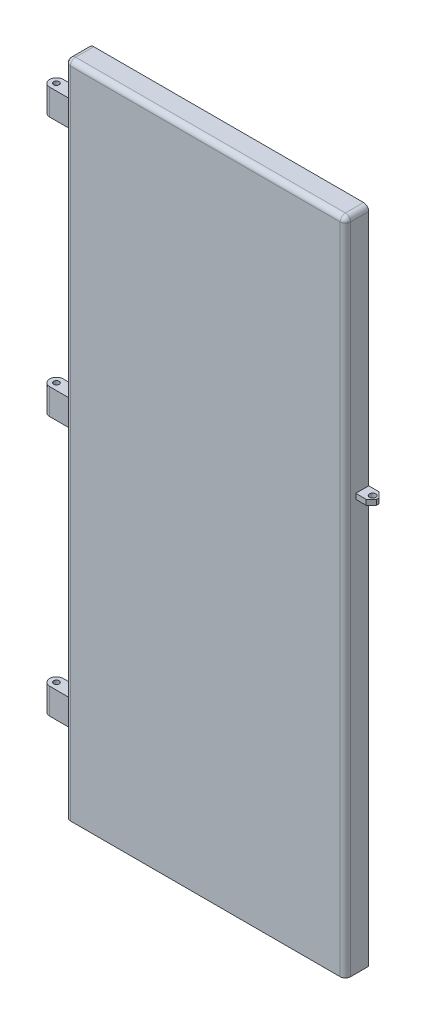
ISO-10303-21;
HEADER;
FILE_DESCRIPTION(('STEP AP214'),'2;1');
FILE_NAME('part.step','',(''),(''),'','','');
FILE_SCHEMA(('AUTOMOTIVE_DESIGN { 1 0 10303 214 1 1 1 1 }'));
ENDSEC;
DATA;
#1=APPLICATION_CONTEXT('core data for automotive mechanical design processes');
#2=APPLICATION_PROTOCOL_DEFINITION('international standard','automotive_design',2000,#1);
#3=PRODUCT_CONTEXT('',#1,'mechanical');
#4=PRODUCT('Part','Part','',(#3));
#5=PRODUCT_RELATED_PRODUCT_CATEGORY('part','',(#4));
#6=PRODUCT_DEFINITION_FORMATION('','',#4);
#7=PRODUCT_DEFINITION_CONTEXT('part definition',#1,'design');
#8=PRODUCT_DEFINITION('design','',#6,#7);
#9=PRODUCT_DEFINITION_SHAPE('','',#8);
#10=(LENGTH_UNIT() NAMED_UNIT(*) SI_UNIT(.MILLI.,.METRE.));
#11=(NAMED_UNIT(*) PLANE_ANGLE_UNIT() SI_UNIT($,.RADIAN.));
#12=(NAMED_UNIT(*) SI_UNIT($,.STERADIAN.) SOLID_ANGLE_UNIT());
#13=UNCERTAINTY_MEASURE_WITH_UNIT(LENGTH_MEASURE(1.E-05),#10,'distance_accuracy_value','');
#14=(GEOMETRIC_REPRESENTATION_CONTEXT(3) GLOBAL_UNCERTAINTY_ASSIGNED_CONTEXT((#13)) GLOBAL_UNIT_ASSIGNED_CONTEXT((#10,
#11,#12)) REPRESENTATION_CONTEXT('',''));
#15=CARTESIAN_POINT('',(0.,0.,0.));
#16=DIRECTION('',(0.,0.,1.));
#17=DIRECTION('',(1.,0.,0.));
#18=AXIS2_PLACEMENT_3D('',#15,#16,#17);
#19=CARTESIAN_POINT('',(270.,-635.,45.));
#20=DIRECTION('',(-1.,0.,0.));
#21=DIRECTION('',(0.,0.,1.));
#22=AXIS2_PLACEMENT_3D('',#19,#20,#21);
#23=PLANE('',#22);
#24=DIRECTION('',(0.,0.,1.));
#25=VECTOR('',#24,1.);
#26=CARTESIAN_POINT('',(270.,167.,0.));
#27=LINE('',#26,#25);
#28=CARTESIAN_POINT('',(270.,167.,0.));
#29=VERTEX_POINT('',#28);
#30=CARTESIAN_POINT('',(270.,167.,25.0000000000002));
#31=VERTEX_POINT('',#30);
#32=EDGE_CURVE('E280',#29,#31,#27,.T.);
#33=ORIENTED_EDGE('',*,*,#32,.F.);
#34=DIRECTION('',(0.,1.,0.));
#35=VECTOR('',#34,1.);
#36=CARTESIAN_POINT('',(270.,-635.,0.));
#37=LINE('',#36,#35);
#38=CARTESIAN_POINT('',(270.,625.,0.));
#39=VERTEX_POINT('',#38);
#40=EDGE_CURVE('E272',#29,#39,#37,.T.);
#41=ORIENTED_EDGE('',*,*,#40,.T.);
#42=DIRECTION('',(0.,0.,-1.));
#43=VECTOR('',#42,1.);
#44=CARTESIAN_POINT('',(270.,625.,45.));
#45=LINE('',#44,#43);
#46=CARTESIAN_POINT('',(270.,625.,35.));
#47=VERTEX_POINT('',#46);
#48=EDGE_CURVE('E507',#39,#47,#45,.F.);
#49=ORIENTED_EDGE('',*,*,#48,.T.);
#50=DIRECTION('',(0.,1.,0.));
#51=VECTOR('',#50,1.);
#52=CARTESIAN_POINT('',(270.,-635.,35.));
#53=LINE('',#52,#51);
#54=CARTESIAN_POINT('',(270.,-635.,35.));
#55=VERTEX_POINT('',#54);
#56=EDGE_CURVE('E509',#47,#55,#53,.F.);
#57=ORIENTED_EDGE('',*,*,#56,.T.);
#58=DIRECTION('',(0.,0.,-1.));
#59=VECTOR('',#58,1.);
#60=CARTESIAN_POINT('',(270.,-635.,45.));
#61=LINE('',#60,#59);
#62=CARTESIAN_POINT('',(270.,-635.,0.));
#63=VERTEX_POINT('',#62);
#64=EDGE_CURVE('E270',#55,#63,#61,.T.);
#65=ORIENTED_EDGE('',*,*,#64,.T.);
#66=CARTESIAN_POINT('',(270.,157.,0.));
#67=VERTEX_POINT('',#66);
#68=EDGE_CURVE('E256',#63,#67,#37,.T.);
#69=ORIENTED_EDGE('',*,*,#68,.T.);
#70=DIRECTION('',(0.,0.,-1.));
#71=VECTOR('',#70,1.);
#72=CARTESIAN_POINT('',(270.,157.,0.));
#73=LINE('',#72,#71);
#74=CARTESIAN_POINT('',(270.,157.,25.0000000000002));
#75=VERTEX_POINT('',#74);
#76=EDGE_CURVE('E267',#75,#67,#73,.T.);
#77=ORIENTED_EDGE('',*,*,#76,.F.);
#78=DIRECTION('',(0.,-1.,0.));
#79=VECTOR('',#78,1.);
#80=CARTESIAN_POINT('',(270.,167.,25.0000000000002));
#81=LINE('',#80,#79);
#82=EDGE_CURVE('E276',#31,#75,#81,.T.);
#83=ORIENTED_EDGE('',*,*,#82,.F.);
#84=EDGE_LOOP('',(#33,#41,#49,#57,#65,#69,#77,#83));
#85=FACE_BOUND('',#84,.T.);
#86=ADVANCED_FACE('F33',(#85),#23,.F.);
#87=CARTESIAN_POINT('',(-270.,-635.,45.));
#88=DIRECTION('',(1.,0.,0.));
#89=DIRECTION('',(0.,0.,-1.));
#90=AXIS2_PLACEMENT_3D('',#87,#88,#89);
#91=PLANE('',#90);
#92=DIRECTION('',(0.,0.,-1.));
#93=VECTOR('',#92,1.);
#94=CARTESIAN_POINT('',(-270.,-490.,35.));
#95=LINE('',#94,#93);
#96=CARTESIAN_POINT('',(-270.,-490.,35.));
#97=VERTEX_POINT('',#96);
#98=CARTESIAN_POINT('',(-270.,-490.,9.));
#99=VERTEX_POINT('',#98);
#100=EDGE_CURVE('E303',#97,#99,#95,.T.);
#101=ORIENTED_EDGE('',*,*,#100,.T.);
#102=DIRECTION('',(0.,1.,0.));
#103=VECTOR('',#102,1.);
#104=CARTESIAN_POINT('',(-270.,-490.,9.));
#105=LINE('',#104,#103);
#106=CARTESIAN_POINT('',(-270.,-440.,9.));
#107=VERTEX_POINT('',#106);
#108=EDGE_CURVE('E322',#99,#107,#105,.T.);
#109=ORIENTED_EDGE('',*,*,#108,.T.);
#110=DIRECTION('',(0.,0.,-1.));
#111=VECTOR('',#110,1.);
#112=CARTESIAN_POINT('',(-270.,-440.,35.));
#113=LINE('',#112,#111);
#114=CARTESIAN_POINT('',(-270.,-440.,35.));
#115=VERTEX_POINT('',#114);
#116=EDGE_CURVE('E314',#115,#107,#113,.T.);
#117=ORIENTED_EDGE('',*,*,#116,.F.);
#118=DIRECTION('',(0.,-1.,0.));
#119=VECTOR('',#118,1.);
#120=CARTESIAN_POINT('',(-270.,-635.,35.));
#121=LINE('',#120,#119);
#122=CARTESIAN_POINT('',(-270.,10.,35.));
#123=VERTEX_POINT('',#122);
#124=EDGE_CURVE('E501',#115,#123,#121,.F.);
#125=ORIENTED_EDGE('',*,*,#124,.T.);
#126=DIRECTION('',(0.,0.,-1.));
#127=VECTOR('',#126,1.);
#128=CARTESIAN_POINT('',(-270.,10.,35.));
#129=LINE('',#128,#127);
#130=CARTESIAN_POINT('',(-270.,10.0000000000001,9.));
#131=VERTEX_POINT('',#130);
#132=EDGE_CURVE('E341',#123,#131,#129,.T.);
#133=ORIENTED_EDGE('',*,*,#132,.T.);
#134=DIRECTION('',(0.,1.,0.));
#135=VECTOR('',#134,1.);
#136=CARTESIAN_POINT('',(-270.,10.,9.));
#137=LINE('',#136,#135);
#138=CARTESIAN_POINT('',(-270.,60.0000000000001,9.));
#139=VERTEX_POINT('',#138);
#140=EDGE_CURVE('E360',#131,#139,#137,.T.);
#141=ORIENTED_EDGE('',*,*,#140,.T.);
#142=DIRECTION('',(0.,0.,-1.));
#143=VECTOR('',#142,1.);
#144=CARTESIAN_POINT('',(-270.,60.0000000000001,35.));
#145=LINE('',#144,#143);
#146=CARTESIAN_POINT('',(-270.,60.0000000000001,35.));
#147=VERTEX_POINT('',#146);
#148=EDGE_CURVE('E352',#147,#139,#145,.T.);
#149=ORIENTED_EDGE('',*,*,#148,.F.);
#150=CARTESIAN_POINT('',(-270.,510.,35.));
#151=VERTEX_POINT('',#150);
#152=EDGE_CURVE('E1173',#147,#151,#121,.F.);
#153=ORIENTED_EDGE('',*,*,#152,.T.);
#154=DIRECTION('',(0.,0.,-1.));
#155=VECTOR('',#154,1.);
#156=CARTESIAN_POINT('',(-270.,510.,35.));
#157=LINE('',#156,#155);
#158=CARTESIAN_POINT('',(-270.,510.,9.));
#159=VERTEX_POINT('',#158);
#160=EDGE_CURVE('E379',#151,#159,#157,.T.);
#161=ORIENTED_EDGE('',*,*,#160,.T.);
#162=DIRECTION('',(0.,1.,0.));
#163=VECTOR('',#162,1.);
#164=CARTESIAN_POINT('',(-270.,510.,9.));
#165=LINE('',#164,#163);
#166=CARTESIAN_POINT('',(-270.,560.,9.));
#167=VERTEX_POINT('',#166);
#168=EDGE_CURVE('E398',#159,#167,#165,.T.);
#169=ORIENTED_EDGE('',*,*,#168,.T.);
#170=DIRECTION('',(0.,0.,-1.));
#171=VECTOR('',#170,1.);
#172=CARTESIAN_POINT('',(-270.,560.,35.));
#173=LINE('',#172,#171);
#174=CARTESIAN_POINT('',(-270.,560.,35.));
#175=VERTEX_POINT('',#174);
#176=EDGE_CURVE('E390',#175,#167,#173,.T.);
#177=ORIENTED_EDGE('',*,*,#176,.F.);
#178=CARTESIAN_POINT('',(-270.,625.,35.));
#179=VERTEX_POINT('',#178);
#180=EDGE_CURVE('E496',#175,#179,#121,.F.);
#181=ORIENTED_EDGE('',*,*,#180,.T.);
#182=DIRECTION('',(0.,0.,-1.));
#183=VECTOR('',#182,1.);
#184=CARTESIAN_POINT('',(-270.,625.,45.));
#185=LINE('',#184,#183);
#186=CARTESIAN_POINT('',(-270.,624.999999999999,0.));
#187=VERTEX_POINT('',#186);
#188=EDGE_CURVE('E494',#179,#187,#185,.T.);
#189=ORIENTED_EDGE('',*,*,#188,.T.);
#190=DIRECTION('',(0.,-1.,0.));
#191=VECTOR('',#190,1.);
#192=CARTESIAN_POINT('',(-270.,-635.,0.));
#193=LINE('',#192,#191);
#194=CARTESIAN_POINT('',(-270.,-635.,0.));
#195=VERTEX_POINT('',#194);
#196=EDGE_CURVE('E474',#187,#195,#193,.T.);
#197=ORIENTED_EDGE('',*,*,#196,.T.);
#198=DIRECTION('',(0.,0.,-1.));
#199=VECTOR('',#198,1.);
#200=CARTESIAN_POINT('',(-270.,-635.,45.));
#201=LINE('',#200,#199);
#202=CARTESIAN_POINT('',(-270.,-635.,35.));
#203=VERTEX_POINT('',#202);
#204=EDGE_CURVE('E480',#203,#195,#201,.T.);
#205=ORIENTED_EDGE('',*,*,#204,.F.);
#206=EDGE_CURVE('E497',#203,#97,#121,.F.);
#207=ORIENTED_EDGE('',*,*,#206,.T.);
#208=EDGE_LOOP('',(#101,#109,#117,#125,#133,#141,#149,#153,#161,#169,#177,#181,#189,#197,#205,#207));
#209=FACE_BOUND('',#208,.T.);
#210=ADVANCED_FACE('F662',(#209),#91,.F.);
#211=CARTESIAN_POINT('',(0.,0.,0.));
#212=DIRECTION('',(0.,0.,-1.));
#213=DIRECTION('',(-1.,0.,0.));
#214=AXIS2_PLACEMENT_3D('',#211,#212,#213);
#215=PLANE('',#214);
#216=DIRECTION('',(-1.,0.,0.));
#217=VECTOR('',#216,1.);
#218=CARTESIAN_POINT('',(300.,167.,0.));
#219=LINE('',#218,#217);
#220=CARTESIAN_POINT('',(290.,167.,0.));
#221=VERTEX_POINT('',#220);
#222=EDGE_CURVE('E287',#221,#29,#219,.T.);
#223=ORIENTED_EDGE('',*,*,#222,.F.);
#224=DIRECTION('',(0.,-1.,0.));
#225=VECTOR('',#224,1.);
#226=CARTESIAN_POINT('',(290.,157.,0.));
#227=LINE('',#226,#225);
#228=CARTESIAN_POINT('',(290.,157.,0.));
#229=VERTEX_POINT('',#228);
#230=EDGE_CURVE('E56',#221,#229,#227,.T.);
#231=ORIENTED_EDGE('',*,*,#230,.T.);
#232=DIRECTION('',(-1.,0.,0.));
#233=VECTOR('',#232,1.);
#234=CARTESIAN_POINT('',(300.,157.,0.));
#235=LINE('',#234,#233);
#236=EDGE_CURVE('E252',#229,#67,#235,.T.);
#237=ORIENTED_EDGE('',*,*,#236,.T.);
#238=ORIENTED_EDGE('',*,*,#68,.F.);
#239=DIRECTION('',(1.,0.,0.));
#240=VECTOR('',#239,1.);
#241=CARTESIAN_POINT('',(-270.,-635.,0.));
#242=LINE('',#241,#240);
#243=CARTESIAN_POINT('',(268.,-635.,0.));
#244=VERTEX_POINT('',#243);
#245=EDGE_CURVE('E476',#244,#63,#242,.T.);
#246=ORIENTED_EDGE('',*,*,#245,.F.);
#247=DIRECTION('',(0.,1.,0.));
#248=VECTOR('',#247,1.);
#249=CARTESIAN_POINT('',(268.,0.,0.));
#250=LINE('',#249,#248);
#251=CARTESIAN_POINT('',(268.,624.999999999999,0.));
#252=VERTEX_POINT('',#251);
#253=EDGE_CURVE('E417',#244,#252,#250,.T.);
#254=ORIENTED_EDGE('',*,*,#253,.T.);
#255=CARTESIAN_POINT('',(260.,625.,0.));
#256=DIRECTION('',(0.,0.,-1.));
#257=DIRECTION('',(-1.,0.,0.));
#258=AXIS2_PLACEMENT_3D('',#255,#256,#257);
#259=CIRCLE('',#258,8.);
#260=CARTESIAN_POINT('',(260.,633.,0.));
#261=VERTEX_POINT('',#260);
#262=EDGE_CURVE('E409',#261,#252,#259,.T.);
#263=ORIENTED_EDGE('',*,*,#262,.F.);
#264=DIRECTION('',(-1.,0.,0.));
#265=VECTOR('',#264,1.);
#266=CARTESIAN_POINT('',(0.,633.,0.));
#267=LINE('',#266,#265);
#268=CARTESIAN_POINT('',(-260.,633.,0.));
#269=VERTEX_POINT('',#268);
#270=EDGE_CURVE('E458',#261,#269,#267,.T.);
#271=ORIENTED_EDGE('',*,*,#270,.T.);
#272=CARTESIAN_POINT('',(-260.,625.,0.));
#273=DIRECTION('',(0.,0.,-1.));
#274=DIRECTION('',(-1.,0.,0.));
#275=AXIS2_PLACEMENT_3D('',#272,#273,#274);
#276=CIRCLE('',#275,8.);
#277=CARTESIAN_POINT('',(-268.,624.999999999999,0.));
#278=VERTEX_POINT('',#277);
#279=EDGE_CURVE('E459',#278,#269,#276,.T.);
#280=ORIENTED_EDGE('',*,*,#279,.F.);
#281=DIRECTION('',(0.,-1.,0.));
#282=VECTOR('',#281,1.);
#283=CARTESIAN_POINT('',(-268.,0.,0.));
#284=LINE('',#283,#282);
#285=CARTESIAN_POINT('',(-268.,-635.,0.));
#286=VERTEX_POINT('',#285);
#287=EDGE_CURVE('E453',#278,#286,#284,.T.);
#288=ORIENTED_EDGE('',*,*,#287,.T.);
#289=EDGE_CURVE('E470',#195,#286,#242,.T.);
#290=ORIENTED_EDGE('',*,*,#289,.F.);
#291=ORIENTED_EDGE('',*,*,#196,.F.);
#292=CARTESIAN_POINT('',(-260.,625.,0.));
#293=DIRECTION('',(0.,0.,-1.));
#294=DIRECTION('',(-1.,0.,0.));
#295=AXIS2_PLACEMENT_3D('',#292,#293,#294);
#296=CIRCLE('',#295,10.);
#297=CARTESIAN_POINT('',(-260.,635.,0.));
#298=VERTEX_POINT('',#297);
#299=EDGE_CURVE('E514',#187,#298,#296,.T.);
#300=ORIENTED_EDGE('',*,*,#299,.T.);
#301=DIRECTION('',(-1.,0.,0.));
#302=VECTOR('',#301,1.);
#303=CARTESIAN_POINT('',(-270.,635.,0.));
#304=LINE('',#303,#302);
#305=CARTESIAN_POINT('',(260.,635.,0.));
#306=VERTEX_POINT('',#305);
#307=EDGE_CURVE('E271',#306,#298,#304,.T.);
#308=ORIENTED_EDGE('',*,*,#307,.F.);
#309=CARTESIAN_POINT('',(260.,625.,0.));
#310=DIRECTION('',(0.,0.,-1.));
#311=DIRECTION('',(-1.,0.,0.));
#312=AXIS2_PLACEMENT_3D('',#309,#310,#311);
#313=CIRCLE('',#312,10.);
#314=EDGE_CURVE('E511',#306,#39,#313,.T.);
#315=ORIENTED_EDGE('',*,*,#314,.T.);
#316=ORIENTED_EDGE('',*,*,#40,.F.);
#317=EDGE_LOOP('',(#223,#231,#237,#238,#246,#254,#263,#271,#280,#288,#290,#291,#300,#308,#315,#316));
#318=FACE_BOUND('',#317,.T.);
#319=ADVANCED_FACE('F254',(#318),#215,.T.);
#320=CARTESIAN_POINT('',(-270.,635.,45.));
#321=DIRECTION('',(0.,-1.,0.));
#322=DIRECTION('',(0.,0.,-1.));
#323=AXIS2_PLACEMENT_3D('',#320,#321,#322);
#324=PLANE('',#323);
#325=ORIENTED_EDGE('',*,*,#307,.T.);
#326=DIRECTION('',(0.,0.,-1.));
#327=VECTOR('',#326,1.);
#328=CARTESIAN_POINT('',(-260.,635.,45.));
#329=LINE('',#328,#327);
#330=CARTESIAN_POINT('',(-260.,635.,35.));
#331=VERTEX_POINT('',#330);
#332=EDGE_CURVE('E505',#298,#331,#329,.F.);
#333=ORIENTED_EDGE('',*,*,#332,.T.);
#334=DIRECTION('',(-1.,0.,0.));
#335=VECTOR('',#334,1.);
#336=CARTESIAN_POINT('',(-270.,635.,35.));
#337=LINE('',#336,#335);
#338=CARTESIAN_POINT('',(260.,635.,35.));
#339=VERTEX_POINT('',#338);
#340=EDGE_CURVE('E503',#331,#339,#337,.F.);
#341=ORIENTED_EDGE('',*,*,#340,.T.);
#342=DIRECTION('',(0.,0.,-1.));
#343=VECTOR('',#342,1.);
#344=CARTESIAN_POINT('',(260.,635.,45.));
#345=LINE('',#344,#343);
#346=EDGE_CURVE('E500',#339,#306,#345,.T.);
#347=ORIENTED_EDGE('',*,*,#346,.T.);
#348=EDGE_LOOP('',(#325,#333,#341,#347));
#349=FACE_BOUND('',#348,.T.);
#350=ADVANCED_FACE('F673',(#349),#324,.F.);
#351=CARTESIAN_POINT('',(-270.,-635.,45.));
#352=DIRECTION('',(0.,1.,0.));
#353=DIRECTION('',(0.,0.,1.));
#354=AXIS2_PLACEMENT_3D('',#351,#352,#353);
#355=PLANE('',#354);
#356=DIRECTION('',(0.,0.,-1.));
#357=VECTOR('',#356,1.);
#358=CARTESIAN_POINT('',(-268.,-635.,45.));
#359=LINE('',#358,#357);
#360=CARTESIAN_POINT('',(-268.,-635.,35.));
#361=VERTEX_POINT('',#360);
#362=EDGE_CURVE('E434',#361,#286,#359,.T.);
#363=ORIENTED_EDGE('',*,*,#362,.F.);
#364=CARTESIAN_POINT('',(-260.,-635.,35.));
#365=DIRECTION('',(0.,1.,0.));
#366=DIRECTION('',(0.,0.,1.));
#367=AXIS2_PLACEMENT_3D('',#364,#365,#366);
#368=CIRCLE('',#367,8.);
#369=CARTESIAN_POINT('',(-260.,-635.,43.));
#370=VERTEX_POINT('',#369);
#371=EDGE_CURVE('E440',#370,#361,#368,.F.);
#372=ORIENTED_EDGE('',*,*,#371,.F.);
#373=DIRECTION('',(1.,0.,0.));
#374=VECTOR('',#373,1.);
#375=CARTESIAN_POINT('',(0.,-635.,43.));
#376=LINE('',#375,#374);
#377=CARTESIAN_POINT('',(260.,-635.,43.));
#378=VERTEX_POINT('',#377);
#379=EDGE_CURVE('E449',#370,#378,#376,.T.);
#380=ORIENTED_EDGE('',*,*,#379,.T.);
#381=CARTESIAN_POINT('',(260.,-635.,35.));
#382=DIRECTION('',(0.,1.,0.));
#383=DIRECTION('',(0.,0.,1.));
#384=AXIS2_PLACEMENT_3D('',#381,#382,#383);
#385=CIRCLE('',#384,8.);
#386=CARTESIAN_POINT('',(268.,-635.,35.));
#387=VERTEX_POINT('',#386);
#388=EDGE_CURVE('E432',#387,#378,#385,.F.);
#389=ORIENTED_EDGE('',*,*,#388,.F.);
#390=DIRECTION('',(0.,0.,-1.));
#391=VECTOR('',#390,1.);
#392=CARTESIAN_POINT('',(268.,-635.,45.));
#393=LINE('',#392,#391);
#394=EDGE_CURVE('E446',#387,#244,#393,.T.);
#395=ORIENTED_EDGE('',*,*,#394,.T.);
#396=ORIENTED_EDGE('',*,*,#245,.T.);
#397=ORIENTED_EDGE('',*,*,#64,.F.);
#398=CARTESIAN_POINT('',(260.,-635.,35.));
#399=DIRECTION('',(0.,1.,0.));
#400=DIRECTION('',(0.,0.,1.));
#401=AXIS2_PLACEMENT_3D('',#398,#399,#400);
#402=CIRCLE('',#401,10.);
#403=CARTESIAN_POINT('',(260.,-635.,45.));
#404=VERTEX_POINT('',#403);
#405=EDGE_CURVE('E490',#55,#404,#402,.F.);
#406=ORIENTED_EDGE('',*,*,#405,.T.);
#407=DIRECTION('',(1.,0.,0.));
#408=VECTOR('',#407,1.);
#409=CARTESIAN_POINT('',(-270.,-635.,45.));
#410=LINE('',#409,#408);
#411=CARTESIAN_POINT('',(-260.,-635.,45.));
#412=VERTEX_POINT('',#411);
#413=EDGE_CURVE('E468',#412,#404,#410,.T.);
#414=ORIENTED_EDGE('',*,*,#413,.F.);
#415=CARTESIAN_POINT('',(-260.,-635.,35.));
#416=DIRECTION('',(0.,1.,0.));
#417=DIRECTION('',(0.,0.,1.));
#418=AXIS2_PLACEMENT_3D('',#415,#416,#417);
#419=CIRCLE('',#418,10.);
#420=EDGE_CURVE('E492',#412,#203,#419,.F.);
#421=ORIENTED_EDGE('',*,*,#420,.T.);
#422=ORIENTED_EDGE('',*,*,#204,.T.);
#423=ORIENTED_EDGE('',*,*,#289,.T.);
#424=EDGE_LOOP('',(#363,#372,#380,#389,#395,#396,#397,#406,#414,#421,#422,#423));
#425=FACE_BOUND('',#424,.T.);
#426=ADVANCED_FACE('F617',(#425),#355,.F.);
#427=CARTESIAN_POINT('',(0.,0.,45.));
#428=DIRECTION('',(0.,0.,-1.));
#429=DIRECTION('',(-1.,0.,0.));
#430=AXIS2_PLACEMENT_3D('',#427,#428,#429);
#431=PLANE('',#430);
#432=DIRECTION('',(-1.,0.,0.));
#433=VECTOR('',#432,1.);
#434=CARTESIAN_POINT('',(0.,625.,45.));
#435=LINE('',#434,#433);
#436=CARTESIAN_POINT('',(260.,625.,45.));
#437=VERTEX_POINT('',#436);
#438=CARTESIAN_POINT('',(-260.,625.,45.));
#439=VERTEX_POINT('',#438);
#440=EDGE_CURVE('E485',#437,#439,#435,.T.);
#441=ORIENTED_EDGE('',*,*,#440,.T.);
#442=DIRECTION('',(0.,-1.,0.));
#443=VECTOR('',#442,1.);
#444=CARTESIAN_POINT('',(-260.,0.,45.));
#445=LINE('',#444,#443);
#446=EDGE_CURVE('E487',#439,#412,#445,.T.);
#447=ORIENTED_EDGE('',*,*,#446,.T.);
#448=ORIENTED_EDGE('',*,*,#413,.T.);
#449=DIRECTION('',(0.,1.,0.));
#450=VECTOR('',#449,1.);
#451=CARTESIAN_POINT('',(260.,0.,45.));
#452=LINE('',#451,#450);
#453=EDGE_CURVE('E483',#404,#437,#452,.T.);
#454=ORIENTED_EDGE('',*,*,#453,.T.);
#455=EDGE_LOOP('',(#441,#447,#448,#454));
#456=FACE_BOUND('',#455,.T.);
#457=ADVANCED_FACE('F699',(#456),#431,.F.);
#458=CARTESIAN_POINT('',(260.,625.,45.));
#459=DIRECTION('',(0.,0.,-1.));
#460=DIRECTION('',(-1.,0.,0.));
#461=AXIS2_PLACEMENT_3D('',#458,#459,#460);
#462=CYLINDRICAL_SURFACE('',#461,10.);
#463=ORIENTED_EDGE('',*,*,#314,.F.);
#464=ORIENTED_EDGE('',*,*,#346,.F.);
#465=CARTESIAN_POINT('',(260.,625.,35.));
#466=DIRECTION('',(0.,0.,1.));
#467=DIRECTION('',(1.,0.,0.));
#468=AXIS2_PLACEMENT_3D('',#465,#466,#467);
#469=CIRCLE('',#468,10.);
#470=EDGE_CURVE('E531',#47,#339,#469,.T.);
#471=ORIENTED_EDGE('',*,*,#470,.F.);
#472=ORIENTED_EDGE('',*,*,#48,.F.);
#473=EDGE_LOOP('',(#463,#464,#471,#472));
#474=FACE_BOUND('',#473,.T.);
#475=ADVANCED_FACE('F696',(#474),#462,.T.);
#476=CARTESIAN_POINT('',(260.,0.,35.));
#477=DIRECTION('',(0.,1.,0.));
#478=DIRECTION('',(0.,0.,1.));
#479=AXIS2_PLACEMENT_3D('',#476,#477,#478);
#480=CYLINDRICAL_SURFACE('',#479,10.);
#481=ORIENTED_EDGE('',*,*,#405,.F.);
#482=ORIENTED_EDGE('',*,*,#56,.F.);
#483=CARTESIAN_POINT('',(260.,625.,35.));
#484=DIRECTION('',(0.,1.,0.));
#485=DIRECTION('',(0.,0.,1.));
#486=AXIS2_PLACEMENT_3D('',#483,#484,#485);
#487=CIRCLE('',#486,10.);
#488=EDGE_CURVE('E528',#437,#47,#487,.T.);
#489=ORIENTED_EDGE('',*,*,#488,.F.);
#490=ORIENTED_EDGE('',*,*,#453,.F.);
#491=EDGE_LOOP('',(#481,#482,#489,#490));
#492=FACE_BOUND('',#491,.T.);
#493=ADVANCED_FACE('F692',(#492),#480,.T.);
#494=CARTESIAN_POINT('',(260.,625.,35.));
#495=DIRECTION('',(0.,0.,1.));
#496=DIRECTION('',(1.,0.,0.));
#497=AXIS2_PLACEMENT_3D('',#494,#495,#496);
#498=SPHERICAL_SURFACE('',#497,10.);
#499=ORIENTED_EDGE('',*,*,#488,.T.);
#500=ORIENTED_EDGE('',*,*,#470,.T.);
#501=CARTESIAN_POINT('',(260.,625.,35.));
#502=DIRECTION('',(1.,0.,0.));
#503=DIRECTION('',(0.,0.,-1.));
#504=AXIS2_PLACEMENT_3D('',#501,#502,#503);
#505=CIRCLE('',#504,10.);
#506=EDGE_CURVE('E525',#437,#339,#505,.F.);
#507=ORIENTED_EDGE('',*,*,#506,.F.);
#508=EDGE_LOOP('',(#499,#500,#507));
#509=FACE_BOUND('',#508,.T.);
#510=ADVANCED_FACE('F688',(#509),#498,.T.);
#511=CARTESIAN_POINT('',(-260.,625.,45.));
#512=DIRECTION('',(0.,0.,-1.));
#513=DIRECTION('',(-1.,0.,0.));
#514=AXIS2_PLACEMENT_3D('',#511,#512,#513);
#515=CYLINDRICAL_SURFACE('',#514,10.);
#516=ORIENTED_EDGE('',*,*,#299,.F.);
#517=ORIENTED_EDGE('',*,*,#188,.F.);
#518=CARTESIAN_POINT('',(-260.,625.,35.));
#519=DIRECTION('',(0.,0.,1.));
#520=DIRECTION('',(1.,0.,0.));
#521=AXIS2_PLACEMENT_3D('',#518,#519,#520);
#522=CIRCLE('',#521,10.);
#523=EDGE_CURVE('E522',#331,#179,#522,.T.);
#524=ORIENTED_EDGE('',*,*,#523,.F.);
#525=ORIENTED_EDGE('',*,*,#332,.F.);
#526=EDGE_LOOP('',(#516,#517,#524,#525));
#527=FACE_BOUND('',#526,.T.);
#528=ADVANCED_FACE('F684',(#527),#515,.T.);
#529=CARTESIAN_POINT('',(0.,625.,35.));
#530=DIRECTION('',(-1.,0.,0.));
#531=DIRECTION('',(0.,0.,1.));
#532=AXIS2_PLACEMENT_3D('',#529,#530,#531);
#533=CYLINDRICAL_SURFACE('',#532,10.);
#534=ORIENTED_EDGE('',*,*,#506,.T.);
#535=ORIENTED_EDGE('',*,*,#340,.F.);
#536=CARTESIAN_POINT('',(-260.,625.,35.));
#537=DIRECTION('',(-1.,0.,0.));
#538=DIRECTION('',(0.,0.,1.));
#539=AXIS2_PLACEMENT_3D('',#536,#537,#538);
#540=CIRCLE('',#539,10.);
#541=EDGE_CURVE('E519',#439,#331,#540,.T.);
#542=ORIENTED_EDGE('',*,*,#541,.F.);
#543=ORIENTED_EDGE('',*,*,#440,.F.);
#544=EDGE_LOOP('',(#534,#535,#542,#543));
#545=FACE_BOUND('',#544,.T.);
#546=ADVANCED_FACE('F680',(#545),#533,.T.);
#547=CARTESIAN_POINT('',(-260.,625.,35.));
#548=DIRECTION('',(0.,0.,1.));
#549=DIRECTION('',(1.,0.,0.));
#550=AXIS2_PLACEMENT_3D('',#547,#548,#549);
#551=SPHERICAL_SURFACE('',#550,10.);
#552=ORIENTED_EDGE('',*,*,#541,.T.);
#553=ORIENTED_EDGE('',*,*,#523,.T.);
#554=CARTESIAN_POINT('',(-260.,625.,35.));
#555=DIRECTION('',(0.,1.,0.));
#556=DIRECTION('',(0.,0.,1.));
#557=AXIS2_PLACEMENT_3D('',#554,#555,#556);
#558=CIRCLE('',#557,10.);
#559=EDGE_CURVE('E461',#439,#179,#558,.F.);
#560=ORIENTED_EDGE('',*,*,#559,.F.);
#561=EDGE_LOOP('',(#552,#553,#560));
#562=FACE_BOUND('',#561,.T.);
#563=ADVANCED_FACE('F676',(#562),#551,.T.);
#564=CARTESIAN_POINT('',(-260.,0.,35.));
#565=DIRECTION('',(0.,-1.,0.));
#566=DIRECTION('',(0.,0.,-1.));
#567=AXIS2_PLACEMENT_3D('',#564,#565,#566);
#568=CYLINDRICAL_SURFACE('',#567,10.);
#569=ORIENTED_EDGE('',*,*,#559,.T.);
#570=ORIENTED_EDGE('',*,*,#180,.F.);
#571=DIRECTION('',(0.,1.,0.));
#572=VECTOR('',#571,1.);
#573=CARTESIAN_POINT('',(-270.,510.,35.));
#574=LINE('',#573,#572);
#575=EDGE_CURVE('E400',#151,#175,#574,.T.);
#576=ORIENTED_EDGE('',*,*,#575,.F.);
#577=ORIENTED_EDGE('',*,*,#152,.F.);
#578=DIRECTION('',(0.,1.,0.));
#579=VECTOR('',#578,1.);
#580=CARTESIAN_POINT('',(-270.,10.,35.));
#581=LINE('',#580,#579);
#582=EDGE_CURVE('E362',#123,#147,#581,.T.);
#583=ORIENTED_EDGE('',*,*,#582,.F.);
#584=ORIENTED_EDGE('',*,*,#124,.F.);
#585=DIRECTION('',(0.,1.,0.));
#586=VECTOR('',#585,1.);
#587=CARTESIAN_POINT('',(-270.,-490.,35.));
#588=LINE('',#587,#586);
#589=EDGE_CURVE('E324',#97,#115,#588,.T.);
#590=ORIENTED_EDGE('',*,*,#589,.F.);
#591=ORIENTED_EDGE('',*,*,#206,.F.);
#592=ORIENTED_EDGE('',*,*,#420,.F.);
#593=ORIENTED_EDGE('',*,*,#446,.F.);
#594=EDGE_LOOP('',(#569,#570,#576,#577,#583,#584,#590,#591,#592,#593));
#595=FACE_BOUND('',#594,.T.);
#596=ADVANCED_FACE('F601',(#595),#568,.T.);
#597=CARTESIAN_POINT('',(268.,-635.,45.));
#598=DIRECTION('',(-1.,0.,0.));
#599=DIRECTION('',(0.,0.,1.));
#600=AXIS2_PLACEMENT_3D('',#597,#598,#599);
#601=PLANE('',#600);
#602=CARTESIAN_POINT('',(268.,-285.,15.0000000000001));
#603=DIRECTION('',(-1.,0.,0.));
#604=DIRECTION('',(0.,0.,1.));
#605=AXIS2_PLACEMENT_3D('',#602,#603,#604);
#606=CIRCLE('',#605,6.);
#607=CARTESIAN_POINT('',(268.,-285.,21.0000000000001));
#608=VERTEX_POINT('',#607);
#609=EDGE_CURVE('E582',#608,#608,#606,.T.);
#610=ORIENTED_EDGE('',*,*,#609,.F.);
#611=EDGE_LOOP('',(#610));
#612=FACE_BOUND('',#611,.T.);
#613=CARTESIAN_POINT('',(268.,64.9999999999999,15.));
#614=DIRECTION('',(-1.,0.,0.));
#615=DIRECTION('',(0.,0.,1.));
#616=AXIS2_PLACEMENT_3D('',#613,#614,#615);
#617=CIRCLE('',#616,6.00000000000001);
#618=CARTESIAN_POINT('',(268.,64.9999999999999,21.));
#619=VERTEX_POINT('',#618);
#620=EDGE_CURVE('E576',#619,#619,#617,.T.);
#621=ORIENTED_EDGE('',*,*,#620,.F.);
#622=EDGE_LOOP('',(#621));
#623=FACE_BOUND('',#622,.T.);
#624=CARTESIAN_POINT('',(268.,415.,15.));
#625=DIRECTION('',(-1.,0.,0.));
#626=DIRECTION('',(0.,0.,1.));
#627=AXIS2_PLACEMENT_3D('',#624,#625,#626);
#628=CIRCLE('',#627,6.00000000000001);
#629=CARTESIAN_POINT('',(268.,415.,21.));
#630=VERTEX_POINT('',#629);
#631=EDGE_CURVE('E570',#630,#630,#628,.T.);
#632=ORIENTED_EDGE('',*,*,#631,.F.);
#633=EDGE_LOOP('',(#632));
#634=FACE_BOUND('',#633,.T.);
#635=DIRECTION('',(0.,0.,1.));
#636=VECTOR('',#635,1.);
#637=CARTESIAN_POINT('',(268.,624.999999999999,45.));
#638=LINE('',#637,#636);
#639=CARTESIAN_POINT('',(268.,625.,35.));
#640=VERTEX_POINT('',#639);
#641=EDGE_CURVE('E404',#252,#640,#638,.T.);
#642=ORIENTED_EDGE('',*,*,#641,.F.);
#643=ORIENTED_EDGE('',*,*,#253,.F.);
#644=ORIENTED_EDGE('',*,*,#394,.F.);
#645=DIRECTION('',(0.,1.,0.));
#646=VECTOR('',#645,1.);
#647=CARTESIAN_POINT('',(268.,-635.,35.));
#648=LINE('',#647,#646);
#649=EDGE_CURVE('E406',#640,#387,#648,.F.);
#650=ORIENTED_EDGE('',*,*,#649,.F.);
#651=EDGE_LOOP('',(#642,#643,#644,#650));
#652=FACE_BOUND('',#651,.T.);
#653=ADVANCED_FACE('F597',(#612,#623,#634,#652),#601,.T.);
#654=CARTESIAN_POINT('',(-270.,633.,45.));
#655=DIRECTION('',(0.,-1.,0.));
#656=DIRECTION('',(0.,0.,-1.));
#657=AXIS2_PLACEMENT_3D('',#654,#655,#656);
#658=PLANE('',#657);
#659=ORIENTED_EDGE('',*,*,#270,.F.);
#660=DIRECTION('',(0.,0.,-1.));
#661=VECTOR('',#660,1.);
#662=CARTESIAN_POINT('',(260.,633.,45.));
#663=LINE('',#662,#661);
#664=CARTESIAN_POINT('',(260.,633.,35.));
#665=VERTEX_POINT('',#664);
#666=EDGE_CURVE('E410',#665,#261,#663,.T.);
#667=ORIENTED_EDGE('',*,*,#666,.F.);
#668=DIRECTION('',(1.,0.,0.));
#669=VECTOR('',#668,1.);
#670=CARTESIAN_POINT('',(-270.,633.,35.));
#671=LINE('',#670,#669);
#672=CARTESIAN_POINT('',(-260.,633.,35.));
#673=VERTEX_POINT('',#672);
#674=EDGE_CURVE('E412',#673,#665,#671,.T.);
#675=ORIENTED_EDGE('',*,*,#674,.F.);
#676=DIRECTION('',(0.,0.,-1.));
#677=VECTOR('',#676,1.);
#678=CARTESIAN_POINT('',(-260.,633.,45.));
#679=LINE('',#678,#677);
#680=EDGE_CURVE('E407',#269,#673,#679,.F.);
#681=ORIENTED_EDGE('',*,*,#680,.F.);
#682=EDGE_LOOP('',(#659,#667,#675,#681));
#683=FACE_BOUND('',#682,.T.);
#684=ADVANCED_FACE('F600',(#683),#658,.T.);
#685=CARTESIAN_POINT('',(-268.,-635.,45.));
#686=DIRECTION('',(1.,0.,0.));
#687=DIRECTION('',(0.,0.,-1.));
#688=AXIS2_PLACEMENT_3D('',#685,#686,#687);
#689=PLANE('',#688);
#690=ORIENTED_EDGE('',*,*,#362,.T.);
#691=ORIENTED_EDGE('',*,*,#287,.F.);
#692=DIRECTION('',(0.,0.,-1.));
#693=VECTOR('',#692,1.);
#694=CARTESIAN_POINT('',(-268.,624.999999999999,45.));
#695=LINE('',#694,#693);
#696=CARTESIAN_POINT('',(-268.,624.999999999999,35.));
#697=VERTEX_POINT('',#696);
#698=EDGE_CURVE('E438',#697,#278,#695,.T.);
#699=ORIENTED_EDGE('',*,*,#698,.F.);
#700=DIRECTION('',(0.,1.,0.));
#701=VECTOR('',#700,1.);
#702=CARTESIAN_POINT('',(-268.,-635.,35.));
#703=LINE('',#702,#701);
#704=EDGE_CURVE('E413',#361,#697,#703,.T.);
#705=ORIENTED_EDGE('',*,*,#704,.F.);
#706=EDGE_LOOP('',(#690,#691,#699,#705));
#707=FACE_BOUND('',#706,.T.);
#708=ADVANCED_FACE('F644',(#707),#689,.T.);
#709=CARTESIAN_POINT('',(0.,0.,43.));
#710=DIRECTION('',(0.,0.,-1.));
#711=DIRECTION('',(-1.,0.,0.));
#712=AXIS2_PLACEMENT_3D('',#709,#710,#711);
#713=PLANE('',#712);
#714=DIRECTION('',(-1.,0.,0.));
#715=VECTOR('',#714,1.);
#716=CARTESIAN_POINT('',(0.,625.,43.));
#717=LINE('',#716,#715);
#718=CARTESIAN_POINT('',(260.,625.,43.));
#719=VERTEX_POINT('',#718);
#720=CARTESIAN_POINT('',(-260.,625.,43.));
#721=VERTEX_POINT('',#720);
#722=EDGE_CURVE('E427',#719,#721,#717,.T.);
#723=ORIENTED_EDGE('',*,*,#722,.F.);
#724=DIRECTION('',(0.,1.,0.));
#725=VECTOR('',#724,1.);
#726=CARTESIAN_POINT('',(260.,0.,43.));
#727=LINE('',#726,#725);
#728=EDGE_CURVE('E430',#378,#719,#727,.T.);
#729=ORIENTED_EDGE('',*,*,#728,.F.);
#730=ORIENTED_EDGE('',*,*,#379,.F.);
#731=DIRECTION('',(0.,1.,0.));
#732=VECTOR('',#731,1.);
#733=CARTESIAN_POINT('',(-260.,0.,43.));
#734=LINE('',#733,#732);
#735=EDGE_CURVE('E429',#721,#370,#734,.F.);
#736=ORIENTED_EDGE('',*,*,#735,.F.);
#737=EDGE_LOOP('',(#723,#729,#730,#736));
#738=FACE_BOUND('',#737,.T.);
#739=ADVANCED_FACE('F628',(#738),#713,.T.);
#740=CARTESIAN_POINT('',(260.,625.,45.));
#741=DIRECTION('',(0.,0.,-1.));
#742=DIRECTION('',(-1.,0.,0.));
#743=AXIS2_PLACEMENT_3D('',#740,#741,#742);
#744=CYLINDRICAL_SURFACE('',#743,8.);
#745=ORIENTED_EDGE('',*,*,#262,.T.);
#746=ORIENTED_EDGE('',*,*,#641,.T.);
#747=CARTESIAN_POINT('',(260.,625.,35.));
#748=DIRECTION('',(0.,0.,1.));
#749=DIRECTION('',(1.,0.,0.));
#750=AXIS2_PLACEMENT_3D('',#747,#748,#749);
#751=CIRCLE('',#750,8.);
#752=EDGE_CURVE('E414',#640,#665,#751,.T.);
#753=ORIENTED_EDGE('',*,*,#752,.T.);
#754=ORIENTED_EDGE('',*,*,#666,.T.);
#755=EDGE_LOOP('',(#745,#746,#753,#754));
#756=FACE_BOUND('',#755,.T.);
#757=ADVANCED_FACE('F612',(#756),#744,.F.);
#758=CARTESIAN_POINT('',(260.,0.,35.));
#759=DIRECTION('',(0.,1.,0.));
#760=DIRECTION('',(0.,0.,1.));
#761=AXIS2_PLACEMENT_3D('',#758,#759,#760);
#762=CYLINDRICAL_SURFACE('',#761,8.);
#763=ORIENTED_EDGE('',*,*,#388,.T.);
#764=ORIENTED_EDGE('',*,*,#728,.T.);
#765=CARTESIAN_POINT('',(260.,625.,35.));
#766=DIRECTION('',(0.,-1.,0.));
#767=DIRECTION('',(0.,0.,-1.));
#768=AXIS2_PLACEMENT_3D('',#765,#766,#767);
#769=CIRCLE('',#768,8.);
#770=EDGE_CURVE('E418',#719,#640,#769,.F.);
#771=ORIENTED_EDGE('',*,*,#770,.T.);
#772=ORIENTED_EDGE('',*,*,#649,.T.);
#773=EDGE_LOOP('',(#763,#764,#771,#772));
#774=FACE_BOUND('',#773,.T.);
#775=ADVANCED_FACE('F624',(#774),#762,.F.);
#776=CARTESIAN_POINT('',(260.,625.,35.));
#777=DIRECTION('',(0.,0.,1.));
#778=DIRECTION('',(1.,0.,0.));
#779=AXIS2_PLACEMENT_3D('',#776,#777,#778);
#780=SPHERICAL_SURFACE('',#779,8.);
#781=ORIENTED_EDGE('',*,*,#770,.F.);
#782=CARTESIAN_POINT('',(260.,625.,35.));
#783=DIRECTION('',(-1.,0.,0.));
#784=DIRECTION('',(0.,0.,1.));
#785=AXIS2_PLACEMENT_3D('',#782,#783,#784);
#786=CIRCLE('',#785,8.);
#787=EDGE_CURVE('E423',#719,#665,#786,.T.);
#788=ORIENTED_EDGE('',*,*,#787,.T.);
#789=ORIENTED_EDGE('',*,*,#752,.F.);
#790=EDGE_LOOP('',(#781,#788,#789));
#791=FACE_BOUND('',#790,.T.);
#792=ADVANCED_FACE('F652',(#791),#780,.F.);
#793=CARTESIAN_POINT('',(-260.,625.,45.));
#794=DIRECTION('',(0.,0.,-1.));
#795=DIRECTION('',(-1.,0.,0.));
#796=AXIS2_PLACEMENT_3D('',#793,#794,#795);
#797=CYLINDRICAL_SURFACE('',#796,8.);
#798=ORIENTED_EDGE('',*,*,#279,.T.);
#799=ORIENTED_EDGE('',*,*,#680,.T.);
#800=CARTESIAN_POINT('',(-260.,625.,35.));
#801=DIRECTION('',(0.,0.,1.));
#802=DIRECTION('',(1.,0.,0.));
#803=AXIS2_PLACEMENT_3D('',#800,#801,#802);
#804=CIRCLE('',#803,8.);
#805=EDGE_CURVE('E426',#673,#697,#804,.T.);
#806=ORIENTED_EDGE('',*,*,#805,.T.);
#807=ORIENTED_EDGE('',*,*,#698,.T.);
#808=EDGE_LOOP('',(#798,#799,#806,#807));
#809=FACE_BOUND('',#808,.T.);
#810=ADVANCED_FACE('F647',(#809),#797,.F.);
#811=CARTESIAN_POINT('',(0.,625.,35.));
#812=DIRECTION('',(-1.,0.,0.));
#813=DIRECTION('',(0.,0.,1.));
#814=AXIS2_PLACEMENT_3D('',#811,#812,#813);
#815=CYLINDRICAL_SURFACE('',#814,8.);
#816=ORIENTED_EDGE('',*,*,#787,.F.);
#817=ORIENTED_EDGE('',*,*,#722,.T.);
#818=CARTESIAN_POINT('',(-260.,625.,35.));
#819=DIRECTION('',(1.,0.,0.));
#820=DIRECTION('',(0.,1.,0.));
#821=AXIS2_PLACEMENT_3D('',#818,#819,#820);
#822=CIRCLE('',#821,8.);
#823=EDGE_CURVE('E435',#721,#673,#822,.F.);
#824=ORIENTED_EDGE('',*,*,#823,.T.);
#825=ORIENTED_EDGE('',*,*,#674,.T.);
#826=EDGE_LOOP('',(#816,#817,#824,#825));
#827=FACE_BOUND('',#826,.T.);
#828=ADVANCED_FACE('F633',(#827),#815,.F.);
#829=CARTESIAN_POINT('',(-260.,625.,35.));
#830=DIRECTION('',(0.,0.,1.));
#831=DIRECTION('',(1.,0.,0.));
#832=AXIS2_PLACEMENT_3D('',#829,#830,#831);
#833=SPHERICAL_SURFACE('',#832,8.);
#834=ORIENTED_EDGE('',*,*,#823,.F.);
#835=CARTESIAN_POINT('',(-260.,625.,35.));
#836=DIRECTION('',(0.,-1.,0.));
#837=DIRECTION('',(0.,0.,-1.));
#838=AXIS2_PLACEMENT_3D('',#835,#836,#837);
#839=CIRCLE('',#838,8.);
#840=EDGE_CURVE('E397',#721,#697,#839,.T.);
#841=ORIENTED_EDGE('',*,*,#840,.T.);
#842=ORIENTED_EDGE('',*,*,#805,.F.);
#843=EDGE_LOOP('',(#834,#841,#842));
#844=FACE_BOUND('',#843,.T.);
#845=ADVANCED_FACE('F637',(#844),#833,.F.);
#846=CARTESIAN_POINT('',(-260.,0.,35.));
#847=DIRECTION('',(0.,-1.,0.));
#848=DIRECTION('',(0.,0.,-1.));
#849=AXIS2_PLACEMENT_3D('',#846,#847,#848);
#850=CYLINDRICAL_SURFACE('',#849,8.);
#851=ORIENTED_EDGE('',*,*,#840,.F.);
#852=ORIENTED_EDGE('',*,*,#735,.T.);
#853=ORIENTED_EDGE('',*,*,#371,.T.);
#854=ORIENTED_EDGE('',*,*,#704,.T.);
#855=EDGE_LOOP('',(#851,#852,#853,#854));
#856=FACE_BOUND('',#855,.T.);
#857=ADVANCED_FACE('F639',(#856),#850,.F.);
#858=CARTESIAN_POINT('',(-310.,510.,22.));
#859=DIRECTION('',(0.,1.,0.));
#860=DIRECTION('',(0.,0.,1.));
#861=AXIS2_PLACEMENT_3D('',#858,#859,#860);
#862=CYLINDRICAL_SURFACE('',#861,13.);
#863=CARTESIAN_POINT('',(-310.,560.,22.));
#864=DIRECTION('',(0.,1.,0.));
#865=DIRECTION('',(0.,0.,1.));
#866=AXIS2_PLACEMENT_3D('',#863,#864,#865);
#867=CIRCLE('',#866,13.);
#868=CARTESIAN_POINT('',(-310.,560.,9.));
#869=VERTEX_POINT('',#868);
#870=CARTESIAN_POINT('',(-310.,560.,35.));
#871=VERTEX_POINT('',#870);
#872=EDGE_CURVE('E369',#869,#871,#867,.T.);
#873=ORIENTED_EDGE('',*,*,#872,.F.);
#874=DIRECTION('',(0.,1.,0.));
#875=VECTOR('',#874,1.);
#876=CARTESIAN_POINT('',(-310.,510.,9.));
#877=LINE('',#876,#875);
#878=CARTESIAN_POINT('',(-310.,510.,9.));
#879=VERTEX_POINT('',#878);
#880=EDGE_CURVE('E395',#879,#869,#877,.T.);
#881=ORIENTED_EDGE('',*,*,#880,.F.);
#882=CARTESIAN_POINT('',(-310.,510.,22.));
#883=DIRECTION('',(0.,1.,0.));
#884=DIRECTION('',(0.,0.,1.));
#885=AXIS2_PLACEMENT_3D('',#882,#883,#884);
#886=CIRCLE('',#885,13.);
#887=CARTESIAN_POINT('',(-310.,510.,35.));
#888=VERTEX_POINT('',#887);
#889=EDGE_CURVE('E372',#879,#888,#886,.T.);
#890=ORIENTED_EDGE('',*,*,#889,.T.);
#891=DIRECTION('',(0.,1.,0.));
#892=VECTOR('',#891,1.);
#893=CARTESIAN_POINT('',(-310.,510.,35.));
#894=LINE('',#893,#892);
#895=EDGE_CURVE('E384',#888,#871,#894,.T.);
#896=ORIENTED_EDGE('',*,*,#895,.T.);
#897=EDGE_LOOP('',(#873,#881,#890,#896));
#898=FACE_BOUND('',#897,.T.);
#899=ADVANCED_FACE('F792',(#898),#862,.T.);
#900=CARTESIAN_POINT('',(-310.,510.,9.));
#901=DIRECTION('',(0.,0.,-1.));
#902=DIRECTION('',(-1.,0.,0.));
#903=AXIS2_PLACEMENT_3D('',#900,#901,#902);
#904=PLANE('',#903);
#905=DIRECTION('',(-1.,0.,0.));
#906=VECTOR('',#905,1.);
#907=CARTESIAN_POINT('',(-310.,560.,9.));
#908=LINE('',#907,#906);
#909=EDGE_CURVE('E376',#167,#869,#908,.T.);
#910=ORIENTED_EDGE('',*,*,#909,.F.);
#911=ORIENTED_EDGE('',*,*,#168,.F.);
#912=DIRECTION('',(-1.,0.,0.));
#913=VECTOR('',#912,1.);
#914=CARTESIAN_POINT('',(-310.,510.,9.));
#915=LINE('',#914,#913);
#916=EDGE_CURVE('E381',#159,#879,#915,.T.);
#917=ORIENTED_EDGE('',*,*,#916,.T.);
#918=ORIENTED_EDGE('',*,*,#880,.T.);
#919=EDGE_LOOP('',(#910,#911,#917,#918));
#920=FACE_BOUND('',#919,.T.);
#921=ADVANCED_FACE('F789',(#920),#904,.T.);
#922=CARTESIAN_POINT('',(-310.,510.,35.));
#923=DIRECTION('',(0.,0.,1.));
#924=DIRECTION('',(1.,0.,0.));
#925=AXIS2_PLACEMENT_3D('',#922,#923,#924);
#926=PLANE('',#925);
#927=DIRECTION('',(1.,0.,0.));
#928=VECTOR('',#927,1.);
#929=CARTESIAN_POINT('',(-310.,560.,35.));
#930=LINE('',#929,#928);
#931=EDGE_CURVE('E387',#871,#175,#930,.T.);
#932=ORIENTED_EDGE('',*,*,#931,.F.);
#933=ORIENTED_EDGE('',*,*,#895,.F.);
#934=DIRECTION('',(1.,0.,0.));
#935=VECTOR('',#934,1.);
#936=CARTESIAN_POINT('',(-310.,510.,35.));
#937=LINE('',#936,#935);
#938=EDGE_CURVE('E375',#888,#151,#937,.T.);
#939=ORIENTED_EDGE('',*,*,#938,.T.);
#940=ORIENTED_EDGE('',*,*,#575,.T.);
#941=EDGE_LOOP('',(#932,#933,#939,#940));
#942=FACE_BOUND('',#941,.T.);
#943=ADVANCED_FACE('F784',(#942),#926,.T.);
#944=CARTESIAN_POINT('',(-310.,510.,22.));
#945=DIRECTION('',(0.,1.,0.));
#946=DIRECTION('',(0.,0.,1.));
#947=AXIS2_PLACEMENT_3D('',#944,#945,#946);
#948=PLANE('',#947);
#949=CARTESIAN_POINT('',(-310.,510.,22.));
#950=DIRECTION('',(0.,1.,0.));
#951=DIRECTION('',(0.,0.,1.));
#952=AXIS2_PLACEMENT_3D('',#949,#950,#951);
#953=CIRCLE('',#952,5.25);
#954=CARTESIAN_POINT('',(-310.,510.,27.25));
#955=VERTEX_POINT('',#954);
#956=EDGE_CURVE('E366',#955,#955,#953,.T.);
#957=ORIENTED_EDGE('',*,*,#956,.T.);
#958=EDGE_LOOP('',(#957));
#959=FACE_BOUND('',#958,.T.);
#960=ORIENTED_EDGE('',*,*,#889,.F.);
#961=ORIENTED_EDGE('',*,*,#916,.F.);
#962=ORIENTED_EDGE('',*,*,#160,.F.);
#963=ORIENTED_EDGE('',*,*,#938,.F.);
#964=EDGE_LOOP('',(#960,#961,#962,#963));
#965=FACE_BOUND('',#964,.T.);
#966=ADVANCED_FACE('F781',(#959,#965),#948,.F.);
#967=CARTESIAN_POINT('',(-310.,560.,22.));
#968=DIRECTION('',(0.,1.,0.));
#969=DIRECTION('',(0.,0.,1.));
#970=AXIS2_PLACEMENT_3D('',#967,#968,#969);
#971=PLANE('',#970);
#972=CARTESIAN_POINT('',(-310.,560.,22.));
#973=DIRECTION('',(0.,1.,0.));
#974=DIRECTION('',(0.,0.,1.));
#975=AXIS2_PLACEMENT_3D('',#972,#973,#974);
#976=CIRCLE('',#975,5.25);
#977=CARTESIAN_POINT('',(-310.,560.,27.25));
#978=VERTEX_POINT('',#977);
#979=EDGE_CURVE('E359',#978,#978,#976,.T.);
#980=ORIENTED_EDGE('',*,*,#979,.F.);
#981=EDGE_LOOP('',(#980));
#982=FACE_BOUND('',#981,.T.);
#983=ORIENTED_EDGE('',*,*,#872,.T.);
#984=ORIENTED_EDGE('',*,*,#931,.T.);
#985=ORIENTED_EDGE('',*,*,#176,.T.);
#986=ORIENTED_EDGE('',*,*,#909,.T.);
#987=EDGE_LOOP('',(#983,#984,#985,#986));
#988=FACE_BOUND('',#987,.T.);
#989=ADVANCED_FACE('F779',(#982,#988),#971,.T.);
#990=CARTESIAN_POINT('',(-310.,510.,22.));
#991=DIRECTION('',(0.,1.,0.));
#992=DIRECTION('',(0.,0.,1.));
#993=AXIS2_PLACEMENT_3D('',#990,#991,#992);
#994=CYLINDRICAL_SURFACE('',#993,5.25);
#995=ORIENTED_EDGE('',*,*,#956,.F.);
#996=EDGE_LOOP('',(#995));
#997=FACE_BOUND('',#996,.T.);
#998=ORIENTED_EDGE('',*,*,#979,.T.);
#999=EDGE_LOOP('',(#998));
#1000=FACE_BOUND('',#999,.T.);
#1001=ADVANCED_FACE('F775',(#997,#1000),#994,.F.);
#1002=CARTESIAN_POINT('',(-310.,10.,22.));
#1003=DIRECTION('',(0.,1.,0.));
#1004=DIRECTION('',(0.,0.,1.));
#1005=AXIS2_PLACEMENT_3D('',#1002,#1003,#1004);
#1006=CYLINDRICAL_SURFACE('',#1005,13.);
#1007=CARTESIAN_POINT('',(-310.,60.0000000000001,22.));
#1008=DIRECTION('',(0.,1.,0.));
#1009=DIRECTION('',(0.,0.,1.));
#1010=AXIS2_PLACEMENT_3D('',#1007,#1008,#1009);
#1011=CIRCLE('',#1010,13.);
#1012=CARTESIAN_POINT('',(-310.,60.0000000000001,9.));
#1013=VERTEX_POINT('',#1012);
#1014=CARTESIAN_POINT('',(-310.,60.0000000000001,35.));
#1015=VERTEX_POINT('',#1014);
#1016=EDGE_CURVE('E331',#1013,#1015,#1011,.T.);
#1017=ORIENTED_EDGE('',*,*,#1016,.F.);
#1018=DIRECTION('',(0.,1.,0.));
#1019=VECTOR('',#1018,1.);
#1020=CARTESIAN_POINT('',(-310.,10.,9.));
#1021=LINE('',#1020,#1019);
#1022=CARTESIAN_POINT('',(-310.,10.,9.));
#1023=VERTEX_POINT('',#1022);
#1024=EDGE_CURVE('E357',#1023,#1013,#1021,.T.);
#1025=ORIENTED_EDGE('',*,*,#1024,.F.);
#1026=CARTESIAN_POINT('',(-310.,10.,22.));
#1027=DIRECTION('',(0.,1.,0.));
#1028=DIRECTION('',(0.,0.,1.));
#1029=AXIS2_PLACEMENT_3D('',#1026,#1027,#1028);
#1030=CIRCLE('',#1029,13.);
#1031=CARTESIAN_POINT('',(-310.,10.,35.));
#1032=VERTEX_POINT('',#1031);
#1033=EDGE_CURVE('E334',#1023,#1032,#1030,.T.);
#1034=ORIENTED_EDGE('',*,*,#1033,.T.);
#1035=DIRECTION('',(0.,1.,0.));
#1036=VECTOR('',#1035,1.);
#1037=CARTESIAN_POINT('',(-310.,10.,35.));
#1038=LINE('',#1037,#1036);
#1039=EDGE_CURVE('E346',#1032,#1015,#1038,.T.);
#1040=ORIENTED_EDGE('',*,*,#1039,.T.);
#1041=EDGE_LOOP('',(#1017,#1025,#1034,#1040));
#1042=FACE_BOUND('',#1041,.T.);
#1043=ADVANCED_FACE('F768',(#1042),#1006,.T.);
#1044=CARTESIAN_POINT('',(-310.,10.,9.));
#1045=DIRECTION('',(0.,0.,-1.));
#1046=DIRECTION('',(-1.,0.,0.));
#1047=AXIS2_PLACEMENT_3D('',#1044,#1045,#1046);
#1048=PLANE('',#1047);
#1049=DIRECTION('',(-1.,0.,0.));
#1050=VECTOR('',#1049,1.);
#1051=CARTESIAN_POINT('',(-310.,60.0000000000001,9.));
#1052=LINE('',#1051,#1050);
#1053=EDGE_CURVE('E338',#139,#1013,#1052,.T.);
#1054=ORIENTED_EDGE('',*,*,#1053,.F.);
#1055=ORIENTED_EDGE('',*,*,#140,.F.);
#1056=DIRECTION('',(-1.,0.,0.));
#1057=VECTOR('',#1056,1.);
#1058=CARTESIAN_POINT('',(-310.,10.,9.));
#1059=LINE('',#1058,#1057);
#1060=EDGE_CURVE('E343',#131,#1023,#1059,.T.);
#1061=ORIENTED_EDGE('',*,*,#1060,.T.);
#1062=ORIENTED_EDGE('',*,*,#1024,.T.);
#1063=EDGE_LOOP('',(#1054,#1055,#1061,#1062));
#1064=FACE_BOUND('',#1063,.T.);
#1065=ADVANCED_FACE('F765',(#1064),#1048,.T.);
#1066=CARTESIAN_POINT('',(-310.,10.,35.));
#1067=DIRECTION('',(0.,0.,1.));
#1068=DIRECTION('',(1.,0.,0.));
#1069=AXIS2_PLACEMENT_3D('',#1066,#1067,#1068);
#1070=PLANE('',#1069);
#1071=DIRECTION('',(1.,0.,0.));
#1072=VECTOR('',#1071,1.);
#1073=CARTESIAN_POINT('',(-310.,60.0000000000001,35.));
#1074=LINE('',#1073,#1072);
#1075=EDGE_CURVE('E349',#1015,#147,#1074,.T.);
#1076=ORIENTED_EDGE('',*,*,#1075,.F.);
#1077=ORIENTED_EDGE('',*,*,#1039,.F.);
#1078=DIRECTION('',(1.,0.,0.));
#1079=VECTOR('',#1078,1.);
#1080=CARTESIAN_POINT('',(-310.,10.,35.));
#1081=LINE('',#1080,#1079);
#1082=EDGE_CURVE('E337',#1032,#123,#1081,.T.);
#1083=ORIENTED_EDGE('',*,*,#1082,.T.);
#1084=ORIENTED_EDGE('',*,*,#582,.T.);
#1085=EDGE_LOOP('',(#1076,#1077,#1083,#1084));
#1086=FACE_BOUND('',#1085,.T.);
#1087=ADVANCED_FACE('F760',(#1086),#1070,.T.);
#1088=CARTESIAN_POINT('',(-310.,10.,22.));
#1089=DIRECTION('',(0.,1.,0.));
#1090=DIRECTION('',(0.,0.,1.));
#1091=AXIS2_PLACEMENT_3D('',#1088,#1089,#1090);
#1092=PLANE('',#1091);
#1093=CARTESIAN_POINT('',(-310.,10.,22.));
#1094=DIRECTION('',(0.,1.,0.));
#1095=DIRECTION('',(0.,0.,1.));
#1096=AXIS2_PLACEMENT_3D('',#1093,#1094,#1095);
#1097=CIRCLE('',#1096,5.25);
#1098=CARTESIAN_POINT('',(-310.,10.,27.25));
#1099=VERTEX_POINT('',#1098);
#1100=EDGE_CURVE('E328',#1099,#1099,#1097,.T.);
#1101=ORIENTED_EDGE('',*,*,#1100,.T.);
#1102=EDGE_LOOP('',(#1101));
#1103=FACE_BOUND('',#1102,.T.);
#1104=ORIENTED_EDGE('',*,*,#1033,.F.);
#1105=ORIENTED_EDGE('',*,*,#1060,.F.);
#1106=ORIENTED_EDGE('',*,*,#132,.F.);
#1107=ORIENTED_EDGE('',*,*,#1082,.F.);
#1108=EDGE_LOOP('',(#1104,#1105,#1106,#1107));
#1109=FACE_BOUND('',#1108,.T.);
#1110=ADVANCED_FACE('F757',(#1103,#1109),#1092,.F.);
#1111=CARTESIAN_POINT('',(-310.,60.0000000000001,22.));
#1112=DIRECTION('',(0.,1.,0.));
#1113=DIRECTION('',(0.,0.,1.));
#1114=AXIS2_PLACEMENT_3D('',#1111,#1112,#1113);
#1115=PLANE('',#1114);
#1116=CARTESIAN_POINT('',(-310.,60.0000000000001,22.));
#1117=DIRECTION('',(0.,1.,0.));
#1118=DIRECTION('',(0.,0.,1.));
#1119=AXIS2_PLACEMENT_3D('',#1116,#1117,#1118);
#1120=CIRCLE('',#1119,5.25);
#1121=CARTESIAN_POINT('',(-310.,60.0000000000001,27.25));
#1122=VERTEX_POINT('',#1121);
#1123=EDGE_CURVE('E321',#1122,#1122,#1120,.T.);
#1124=ORIENTED_EDGE('',*,*,#1123,.F.);
#1125=EDGE_LOOP('',(#1124));
#1126=FACE_BOUND('',#1125,.T.);
#1127=ORIENTED_EDGE('',*,*,#1016,.T.);
#1128=ORIENTED_EDGE('',*,*,#1075,.T.);
#1129=ORIENTED_EDGE('',*,*,#148,.T.);
#1130=ORIENTED_EDGE('',*,*,#1053,.T.);
#1131=EDGE_LOOP('',(#1127,#1128,#1129,#1130));
#1132=FACE_BOUND('',#1131,.T.);
#1133=ADVANCED_FACE('F755',(#1126,#1132),#1115,.T.);
#1134=CARTESIAN_POINT('',(-310.,10.,22.));
#1135=DIRECTION('',(0.,1.,0.));
#1136=DIRECTION('',(0.,0.,1.));
#1137=AXIS2_PLACEMENT_3D('',#1134,#1135,#1136);
#1138=CYLINDRICAL_SURFACE('',#1137,5.25);
#1139=ORIENTED_EDGE('',*,*,#1100,.F.);
#1140=EDGE_LOOP('',(#1139));
#1141=FACE_BOUND('',#1140,.T.);
#1142=ORIENTED_EDGE('',*,*,#1123,.T.);
#1143=EDGE_LOOP('',(#1142));
#1144=FACE_BOUND('',#1143,.T.);
#1145=ADVANCED_FACE('F751',(#1141,#1144),#1138,.F.);
#1146=CARTESIAN_POINT('',(-310.,-490.,22.));
#1147=DIRECTION('',(0.,1.,0.));
#1148=DIRECTION('',(0.,0.,1.));
#1149=AXIS2_PLACEMENT_3D('',#1146,#1147,#1148);
#1150=CYLINDRICAL_SURFACE('',#1149,13.);
#1151=CARTESIAN_POINT('',(-310.,-440.,22.));
#1152=DIRECTION('',(0.,1.,0.));
#1153=DIRECTION('',(0.,0.,1.));
#1154=AXIS2_PLACEMENT_3D('',#1151,#1152,#1153);
#1155=CIRCLE('',#1154,13.);
#1156=CARTESIAN_POINT('',(-310.,-440.,9.));
#1157=VERTEX_POINT('',#1156);
#1158=CARTESIAN_POINT('',(-310.,-440.,35.));
#1159=VERTEX_POINT('',#1158);
#1160=EDGE_CURVE('E293',#1157,#1159,#1155,.T.);
#1161=ORIENTED_EDGE('',*,*,#1160,.F.);
#1162=DIRECTION('',(0.,1.,0.));
#1163=VECTOR('',#1162,1.);
#1164=CARTESIAN_POINT('',(-310.,-490.,9.));
#1165=LINE('',#1164,#1163);
#1166=CARTESIAN_POINT('',(-310.,-490.,9.));
#1167=VERTEX_POINT('',#1166);
#1168=EDGE_CURVE('E319',#1167,#1157,#1165,.T.);
#1169=ORIENTED_EDGE('',*,*,#1168,.F.);
#1170=CARTESIAN_POINT('',(-310.,-490.,22.));
#1171=DIRECTION('',(0.,1.,0.));
#1172=DIRECTION('',(0.,0.,1.));
#1173=AXIS2_PLACEMENT_3D('',#1170,#1171,#1172);
#1174=CIRCLE('',#1173,13.);
#1175=CARTESIAN_POINT('',(-310.,-490.,35.));
#1176=VERTEX_POINT('',#1175);
#1177=EDGE_CURVE('E296',#1167,#1176,#1174,.T.);
#1178=ORIENTED_EDGE('',*,*,#1177,.T.);
#1179=DIRECTION('',(0.,1.,0.));
#1180=VECTOR('',#1179,1.);
#1181=CARTESIAN_POINT('',(-310.,-490.,35.));
#1182=LINE('',#1181,#1180);
#1183=EDGE_CURVE('E308',#1176,#1159,#1182,.T.);
#1184=ORIENTED_EDGE('',*,*,#1183,.T.);
#1185=EDGE_LOOP('',(#1161,#1169,#1178,#1184));
#1186=FACE_BOUND('',#1185,.T.);
#1187=ADVANCED_FACE('F744',(#1186),#1150,.T.);
#1188=CARTESIAN_POINT('',(-310.,-490.,9.));
#1189=DIRECTION('',(0.,0.,-1.));
#1190=DIRECTION('',(-1.,0.,0.));
#1191=AXIS2_PLACEMENT_3D('',#1188,#1189,#1190);
#1192=PLANE('',#1191);
#1193=DIRECTION('',(-1.,0.,0.));
#1194=VECTOR('',#1193,1.);
#1195=CARTESIAN_POINT('',(-310.,-440.,9.));
#1196=LINE('',#1195,#1194);
#1197=EDGE_CURVE('E300',#107,#1157,#1196,.T.);
#1198=ORIENTED_EDGE('',*,*,#1197,.F.);
#1199=ORIENTED_EDGE('',*,*,#108,.F.);
#1200=DIRECTION('',(-1.,0.,0.));
#1201=VECTOR('',#1200,1.);
#1202=CARTESIAN_POINT('',(-310.,-490.,9.));
#1203=LINE('',#1202,#1201);
#1204=EDGE_CURVE('E305',#99,#1167,#1203,.T.);
#1205=ORIENTED_EDGE('',*,*,#1204,.T.);
#1206=ORIENTED_EDGE('',*,*,#1168,.T.);
#1207=EDGE_LOOP('',(#1198,#1199,#1205,#1206));
#1208=FACE_BOUND('',#1207,.T.);
#1209=ADVANCED_FACE('F741',(#1208),#1192,.T.);
#1210=CARTESIAN_POINT('',(-310.,-490.,35.));
#1211=DIRECTION('',(0.,0.,1.));
#1212=DIRECTION('',(1.,0.,0.));
#1213=AXIS2_PLACEMENT_3D('',#1210,#1211,#1212);
#1214=PLANE('',#1213);
#1215=DIRECTION('',(1.,0.,0.));
#1216=VECTOR('',#1215,1.);
#1217=CARTESIAN_POINT('',(-310.,-440.,35.));
#1218=LINE('',#1217,#1216);
#1219=EDGE_CURVE('E311',#1159,#115,#1218,.T.);
#1220=ORIENTED_EDGE('',*,*,#1219,.F.);
#1221=ORIENTED_EDGE('',*,*,#1183,.F.);
#1222=DIRECTION('',(1.,0.,0.));
#1223=VECTOR('',#1222,1.);
#1224=CARTESIAN_POINT('',(-310.,-490.,35.));
#1225=LINE('',#1224,#1223);
#1226=EDGE_CURVE('E299',#1176,#97,#1225,.T.);
#1227=ORIENTED_EDGE('',*,*,#1226,.T.);
#1228=ORIENTED_EDGE('',*,*,#589,.T.);
#1229=EDGE_LOOP('',(#1220,#1221,#1227,#1228));
#1230=FACE_BOUND('',#1229,.T.);
#1231=ADVANCED_FACE('F736',(#1230),#1214,.T.);
#1232=CARTESIAN_POINT('',(-310.,-490.,22.));
#1233=DIRECTION('',(0.,1.,0.));
#1234=DIRECTION('',(0.,0.,1.));
#1235=AXIS2_PLACEMENT_3D('',#1232,#1233,#1234);
#1236=PLANE('',#1235);
#1237=CARTESIAN_POINT('',(-310.,-490.,22.));
#1238=DIRECTION('',(0.,1.,0.));
#1239=DIRECTION('',(0.,0.,1.));
#1240=AXIS2_PLACEMENT_3D('',#1237,#1238,#1239);
#1241=CIRCLE('',#1240,5.25);
#1242=CARTESIAN_POINT('',(-310.,-490.,27.25));
#1243=VERTEX_POINT('',#1242);
#1244=EDGE_CURVE('E290',#1243,#1243,#1241,.T.);
#1245=ORIENTED_EDGE('',*,*,#1244,.T.);
#1246=EDGE_LOOP('',(#1245));
#1247=FACE_BOUND('',#1246,.T.);
#1248=ORIENTED_EDGE('',*,*,#1177,.F.);
#1249=ORIENTED_EDGE('',*,*,#1204,.F.);
#1250=ORIENTED_EDGE('',*,*,#100,.F.);
#1251=ORIENTED_EDGE('',*,*,#1226,.F.);
#1252=EDGE_LOOP('',(#1248,#1249,#1250,#1251));
#1253=FACE_BOUND('',#1252,.T.);
#1254=ADVANCED_FACE('F733',(#1247,#1253),#1236,.F.);
#1255=CARTESIAN_POINT('',(-310.,-440.,22.));
#1256=DIRECTION('',(0.,1.,0.));
#1257=DIRECTION('',(0.,0.,1.));
#1258=AXIS2_PLACEMENT_3D('',#1255,#1256,#1257);
#1259=PLANE('',#1258);
#1260=CARTESIAN_POINT('',(-310.,-440.,22.));
#1261=DIRECTION('',(0.,1.,0.));
#1262=DIRECTION('',(0.,0.,1.));
#1263=AXIS2_PLACEMENT_3D('',#1260,#1261,#1262);
#1264=CIRCLE('',#1263,5.25);
#1265=CARTESIAN_POINT('',(-310.,-440.,27.25));
#1266=VERTEX_POINT('',#1265);
#1267=EDGE_CURVE('E289',#1266,#1266,#1264,.T.);
#1268=ORIENTED_EDGE('',*,*,#1267,.F.);
#1269=EDGE_LOOP('',(#1268));
#1270=FACE_BOUND('',#1269,.T.);
#1271=ORIENTED_EDGE('',*,*,#1160,.T.);
#1272=ORIENTED_EDGE('',*,*,#1219,.T.);
#1273=ORIENTED_EDGE('',*,*,#116,.T.);
#1274=ORIENTED_EDGE('',*,*,#1197,.T.);
#1275=EDGE_LOOP('',(#1271,#1272,#1273,#1274));
#1276=FACE_BOUND('',#1275,.T.);
#1277=ADVANCED_FACE('F731',(#1270,#1276),#1259,.T.);
#1278=CARTESIAN_POINT('',(-310.,-490.,22.));
#1279=DIRECTION('',(0.,1.,0.));
#1280=DIRECTION('',(0.,0.,1.));
#1281=AXIS2_PLACEMENT_3D('',#1278,#1279,#1280);
#1282=CYLINDRICAL_SURFACE('',#1281,5.25);
#1283=ORIENTED_EDGE('',*,*,#1244,.F.);
#1284=EDGE_LOOP('',(#1283));
#1285=FACE_BOUND('',#1284,.T.);
#1286=ORIENTED_EDGE('',*,*,#1267,.T.);
#1287=EDGE_LOOP('',(#1286));
#1288=FACE_BOUND('',#1287,.T.);
#1289=ADVANCED_FACE('F727',(#1285,#1288),#1282,.F.);
#1290=CARTESIAN_POINT('',(300.,167.,0.));
#1291=DIRECTION('',(0.,-1.,0.));
#1292=DIRECTION('',(0.,0.,-1.));
#1293=AXIS2_PLACEMENT_3D('',#1290,#1291,#1292);
#1294=PLANE('',#1293);
#1295=CARTESIAN_POINT('',(290.,167.,12.5));
#1296=DIRECTION('',(0.,1.,0.));
#1297=DIRECTION('',(0.,0.,1.));
#1298=AXIS2_PLACEMENT_3D('',#1295,#1296,#1297);
#1299=CIRCLE('',#1298,5.99999999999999);
#1300=CARTESIAN_POINT('',(290.,167.,18.5));
#1301=VERTEX_POINT('',#1300);
#1302=EDGE_CURVE('E564',#1301,#1301,#1299,.T.);
#1303=ORIENTED_EDGE('',*,*,#1302,.F.);
#1304=EDGE_LOOP('',(#1303));
#1305=FACE_BOUND('',#1304,.T.);
#1306=DIRECTION('',(0.,0.,1.));
#1307=VECTOR('',#1306,1.);
#1308=CARTESIAN_POINT('',(300.,167.,0.));
#1309=LINE('',#1308,#1307);
#1310=CARTESIAN_POINT('',(300.,167.,10.));
#1311=VERTEX_POINT('',#1310);
#1312=CARTESIAN_POINT('',(300.,167.,15.0000000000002));
#1313=VERTEX_POINT('',#1312);
#1314=EDGE_CURVE('E275',#1311,#1313,#1309,.T.);
#1315=ORIENTED_EDGE('',*,*,#1314,.F.);
#1316=DIRECTION('',(-0.707106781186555,0.,-0.70710678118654));
#1317=VECTOR('',#1316,1.);
#1318=CARTESIAN_POINT('',(300.,167.,10.));
#1319=LINE('',#1318,#1317);
#1320=EDGE_CURVE('E541',#1311,#221,#1319,.T.);
#1321=ORIENTED_EDGE('',*,*,#1320,.T.);
#1322=ORIENTED_EDGE('',*,*,#222,.T.);
#1323=ORIENTED_EDGE('',*,*,#32,.T.);
#1324=DIRECTION('',(-1.,0.,0.));
#1325=VECTOR('',#1324,1.);
#1326=CARTESIAN_POINT('',(300.,167.,25.0000000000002));
#1327=LINE('',#1326,#1325);
#1328=CARTESIAN_POINT('',(290.,167.,25.0000000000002));
#1329=VERTEX_POINT('',#1328);
#1330=EDGE_CURVE('E285',#1329,#31,#1327,.T.);
#1331=ORIENTED_EDGE('',*,*,#1330,.F.);
#1332=DIRECTION('',(-0.707106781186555,0.,0.70710678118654));
#1333=VECTOR('',#1332,1.);
#1334=CARTESIAN_POINT('',(300.,167.,15.0000000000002));
#1335=LINE('',#1334,#1333);
#1336=EDGE_CURVE('E539',#1329,#1313,#1335,.F.);
#1337=ORIENTED_EDGE('',*,*,#1336,.T.);
#1338=EDGE_LOOP('',(#1315,#1321,#1322,#1323,#1331,#1337));
#1339=FACE_BOUND('',#1338,.T.);
#1340=ADVANCED_FACE('F554',(#1305,#1339),#1294,.F.);
#1341=CARTESIAN_POINT('',(300.,167.,25.0000000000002));
#1342=DIRECTION('',(0.,0.,-1.));
#1343=DIRECTION('',(0.,1.,0.));
#1344=AXIS2_PLACEMENT_3D('',#1341,#1342,#1343);
#1345=PLANE('',#1344);
#1346=DIRECTION('',(-1.,0.,0.));
#1347=VECTOR('',#1346,1.);
#1348=CARTESIAN_POINT('',(300.,157.,25.0000000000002));
#1349=LINE('',#1348,#1347);
#1350=CARTESIAN_POINT('',(290.,157.,25.0000000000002));
#1351=VERTEX_POINT('',#1350);
#1352=EDGE_CURVE('E259',#1351,#75,#1349,.T.);
#1353=ORIENTED_EDGE('',*,*,#1352,.F.);
#1354=DIRECTION('',(0.,1.,0.));
#1355=VECTOR('',#1354,1.);
#1356=CARTESIAN_POINT('',(290.,167.,25.0000000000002));
#1357=LINE('',#1356,#1355);
#1358=EDGE_CURVE('E11',#1351,#1329,#1357,.T.);
#1359=ORIENTED_EDGE('',*,*,#1358,.T.);
#1360=ORIENTED_EDGE('',*,*,#1330,.T.);
#1361=ORIENTED_EDGE('',*,*,#82,.T.);
#1362=EDGE_LOOP('',(#1353,#1359,#1360,#1361));
#1363=FACE_BOUND('',#1362,.T.);
#1364=ADVANCED_FACE('F720',(#1363),#1345,.F.);
#1365=CARTESIAN_POINT('',(300.,157.,0.));
#1366=DIRECTION('',(0.,1.,0.));
#1367=DIRECTION('',(0.,0.,1.));
#1368=AXIS2_PLACEMENT_3D('',#1365,#1366,#1367);
#1369=PLANE('',#1368);
#1370=CARTESIAN_POINT('',(290.,157.,12.5));
#1371=DIRECTION('',(0.,1.,0.));
#1372=DIRECTION('',(0.,0.,1.));
#1373=AXIS2_PLACEMENT_3D('',#1370,#1371,#1372);
#1374=CIRCLE('',#1373,5.99999999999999);
#1375=CARTESIAN_POINT('',(290.,157.,18.5));
#1376=VERTEX_POINT('',#1375);
#1377=EDGE_CURVE('E562',#1376,#1376,#1374,.F.);
#1378=ORIENTED_EDGE('',*,*,#1377,.F.);
#1379=EDGE_LOOP('',(#1378));
#1380=FACE_BOUND('',#1379,.T.);
#1381=ORIENTED_EDGE('',*,*,#236,.F.);
#1382=DIRECTION('',(0.707106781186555,0.,0.70710678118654));
#1383=VECTOR('',#1382,1.);
#1384=CARTESIAN_POINT('',(300.,157.,10.));
#1385=LINE('',#1384,#1383);
#1386=CARTESIAN_POINT('',(300.,157.,10.));
#1387=VERTEX_POINT('',#1386);
#1388=EDGE_CURVE('E41',#229,#1387,#1385,.T.);
#1389=ORIENTED_EDGE('',*,*,#1388,.T.);
#1390=DIRECTION('',(0.,0.,-1.));
#1391=VECTOR('',#1390,1.);
#1392=CARTESIAN_POINT('',(300.,157.,0.));
#1393=LINE('',#1392,#1391);
#1394=CARTESIAN_POINT('',(300.,157.,15.0000000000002));
#1395=VERTEX_POINT('',#1394);
#1396=EDGE_CURVE('E260',#1395,#1387,#1393,.T.);
#1397=ORIENTED_EDGE('',*,*,#1396,.F.);
#1398=DIRECTION('',(0.707106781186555,0.,-0.70710678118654));
#1399=VECTOR('',#1398,1.);
#1400=CARTESIAN_POINT('',(300.,157.,15.0000000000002));
#1401=LINE('',#1400,#1399);
#1402=EDGE_CURVE('E48',#1395,#1351,#1401,.F.);
#1403=ORIENTED_EDGE('',*,*,#1402,.T.);
#1404=ORIENTED_EDGE('',*,*,#1352,.T.);
#1405=ORIENTED_EDGE('',*,*,#76,.T.);
#1406=EDGE_LOOP('',(#1381,#1389,#1397,#1403,#1404,#1405));
#1407=FACE_BOUND('',#1406,.T.);
#1408=ADVANCED_FACE('F274',(#1380,#1407),#1369,.F.);
#1409=CARTESIAN_POINT('',(300.,0.,0.));
#1410=DIRECTION('',(-1.,0.,0.));
#1411=DIRECTION('',(0.,0.,1.));
#1412=AXIS2_PLACEMENT_3D('',#1409,#1410,#1411);
#1413=PLANE('',#1412);
#1414=ORIENTED_EDGE('',*,*,#1396,.T.);
#1415=DIRECTION('',(0.,1.,0.));
#1416=VECTOR('',#1415,1.);
#1417=CARTESIAN_POINT('',(300.,167.,10.));
#1418=LINE('',#1417,#1416);
#1419=EDGE_CURVE('E536',#1387,#1311,#1418,.T.);
#1420=ORIENTED_EDGE('',*,*,#1419,.T.);
#1421=ORIENTED_EDGE('',*,*,#1314,.T.);
#1422=DIRECTION('',(0.,-1.,0.));
#1423=VECTOR('',#1422,1.);
#1424=CARTESIAN_POINT('',(300.,0.,15.0000000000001));
#1425=LINE('',#1424,#1423);
#1426=EDGE_CURVE('E516',#1313,#1395,#1425,.T.);
#1427=ORIENTED_EDGE('',*,*,#1426,.T.);
#1428=EDGE_LOOP('',(#1414,#1420,#1421,#1427));
#1429=FACE_BOUND('',#1428,.T.);
#1430=ADVANCED_FACE('F548',(#1429),#1413,.F.);
#1431=CARTESIAN_POINT('',(290.,140.029437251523,12.5));
#1432=DIRECTION('',(0.,1.,0.));
#1433=DIRECTION('',(0.,0.,1.));
#1434=AXIS2_PLACEMENT_3D('',#1431,#1432,#1433);
#1435=CYLINDRICAL_SURFACE('',#1434,5.99999999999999);
#1436=CARTESIAN_POINT('',(290.,157.,18.5));
#1437=CARTESIAN_POINT('',(290.,157.104166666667,18.5));
#1438=CARTESIAN_POINT('',(290.,157.208333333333,18.5));
#1439=CARTESIAN_POINT('',(290.,157.416666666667,18.5));
#1440=CARTESIAN_POINT('',(290.,157.520833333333,18.5));
#1441=CARTESIAN_POINT('',(290.,157.729166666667,18.5));
#1442=CARTESIAN_POINT('',(290.,157.833333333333,18.5));
#1443=CARTESIAN_POINT('',(290.,158.041666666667,18.5));
#1444=CARTESIAN_POINT('',(290.,158.145833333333,18.5));
#1445=CARTESIAN_POINT('',(290.,158.354166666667,18.5));
#1446=CARTESIAN_POINT('',(290.,158.458333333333,18.5));
#1447=CARTESIAN_POINT('',(290.,158.666666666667,18.5));
#1448=CARTESIAN_POINT('',(290.,158.770833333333,18.5));
#1449=CARTESIAN_POINT('',(290.,158.979166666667,18.5));
#1450=CARTESIAN_POINT('',(290.,159.083333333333,18.5));
#1451=CARTESIAN_POINT('',(290.,159.291666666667,18.5));
#1452=CARTESIAN_POINT('',(290.,159.395833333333,18.5));
#1453=CARTESIAN_POINT('',(290.,159.604166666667,18.5));
#1454=CARTESIAN_POINT('',(290.,159.708333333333,18.5));
#1455=CARTESIAN_POINT('',(290.,159.916666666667,18.5));
#1456=CARTESIAN_POINT('',(290.,160.020833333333,18.5));
#1457=CARTESIAN_POINT('',(290.,160.229166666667,18.5));
#1458=CARTESIAN_POINT('',(290.,160.333333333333,18.5));
#1459=CARTESIAN_POINT('',(290.,160.541666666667,18.5));
#1460=CARTESIAN_POINT('',(290.,160.645833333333,18.5));
#1461=CARTESIAN_POINT('',(290.,160.854166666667,18.5));
#1462=CARTESIAN_POINT('',(290.,160.958333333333,18.5));
#1463=CARTESIAN_POINT('',(290.,161.166666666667,18.5));
#1464=CARTESIAN_POINT('',(290.,161.270833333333,18.5));
#1465=CARTESIAN_POINT('',(290.,161.479166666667,18.5));
#1466=CARTESIAN_POINT('',(290.,161.583333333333,18.5));
#1467=CARTESIAN_POINT('',(290.,161.791666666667,18.5));
#1468=CARTESIAN_POINT('',(290.,161.895833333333,18.5));
#1469=CARTESIAN_POINT('',(290.,162.104166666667,18.5));
#1470=CARTESIAN_POINT('',(290.,162.208333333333,18.5));
#1471=CARTESIAN_POINT('',(290.,162.416666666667,18.5));
#1472=CARTESIAN_POINT('',(290.,162.520833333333,18.5));
#1473=CARTESIAN_POINT('',(290.,162.729166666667,18.5));
#1474=CARTESIAN_POINT('',(290.,162.833333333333,18.5));
#1475=CARTESIAN_POINT('',(290.,163.041666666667,18.5));
#1476=CARTESIAN_POINT('',(290.,163.145833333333,18.5));
#1477=CARTESIAN_POINT('',(290.,163.354166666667,18.5));
#1478=CARTESIAN_POINT('',(290.,163.458333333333,18.5));
#1479=CARTESIAN_POINT('',(290.,163.666666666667,18.5));
#1480=CARTESIAN_POINT('',(290.,163.770833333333,18.5));
#1481=CARTESIAN_POINT('',(290.,163.979166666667,18.5));
#1482=CARTESIAN_POINT('',(290.,164.083333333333,18.5));
#1483=CARTESIAN_POINT('',(290.,164.291666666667,18.5));
#1484=CARTESIAN_POINT('',(290.,164.395833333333,18.5));
#1485=CARTESIAN_POINT('',(290.,164.604166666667,18.5));
#1486=CARTESIAN_POINT('',(290.,164.708333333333,18.5));
#1487=CARTESIAN_POINT('',(290.,164.916666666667,18.5));
#1488=CARTESIAN_POINT('',(290.,165.020833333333,18.5));
#1489=CARTESIAN_POINT('',(290.,165.229166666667,18.5));
#1490=CARTESIAN_POINT('',(290.,165.333333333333,18.5));
#1491=CARTESIAN_POINT('',(290.,165.541666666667,18.5));
#1492=CARTESIAN_POINT('',(290.,165.645833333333,18.5));
#1493=CARTESIAN_POINT('',(290.,165.854166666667,18.5));
#1494=CARTESIAN_POINT('',(290.,165.958333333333,18.5));
#1495=CARTESIAN_POINT('',(290.,166.166666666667,18.5));
#1496=CARTESIAN_POINT('',(290.,166.270833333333,18.5));
#1497=CARTESIAN_POINT('',(290.,166.479166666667,18.5));
#1498=CARTESIAN_POINT('',(290.,166.583333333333,18.5));
#1499=CARTESIAN_POINT('',(290.,166.791666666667,18.5));
#1500=CARTESIAN_POINT('',(290.,166.895833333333,18.5));
#1501=CARTESIAN_POINT('',(290.,167.,18.5));
#1502=B_SPLINE_CURVE_WITH_KNOTS('',3,(#1436,#1437,#1438,#1439,#1440,#1441,#1442,#1443,#1444,
#1445,#1446,#1447,#1448,#1449,#1450,#1451,#1452,#1453,#1454,#1455,#1456,#1457,#1458,#1459,#1460,
#1461,#1462,#1463,#1464,#1465,#1466,#1467,#1468,#1469,#1470,#1471,#1472,#1473,#1474,#1475,#1476,
#1477,#1478,#1479,#1480,#1481,#1482,#1483,#1484,#1485,#1486,#1487,#1488,#1489,#1490,#1491,#1492,
#1493,#1494,#1495,#1496,#1497,#1498,#1499,#1500,#1501),.UNSPECIFIED.,.F.,.F.,(4,2,2,2,2,2,2,2,2,
2,2,2,2,2,2,2,2,2,2,2,2,2,2,2,2,2,2,2,2,2,2,2,4),(0.,0.312500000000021,0.625000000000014,
0.937500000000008,1.25,1.56250000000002,1.87500000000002,2.18750000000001,2.5,2.81250000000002,
3.12500000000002,3.43750000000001,3.75,4.06250000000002,4.37500000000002,4.68750000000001,5.,
5.31250000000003,5.62500000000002,5.93750000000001,6.25000000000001,6.56250000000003,
6.87500000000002,7.18750000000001,7.50000000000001,7.81250000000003,8.12500000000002,
8.43750000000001,8.75000000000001,9.06250000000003,9.37500000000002,9.68750000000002,10.),.UNSPECIFIED.);
#1503=EDGE_CURVE('BSEAM702',#1376,#1301,#1502,.T.);
#1504=ORIENTED_EDGE('',*,*,#1377,.T.);
#1505=ORIENTED_EDGE('',*,*,#1302,.T.);
#1506=ORIENTED_EDGE('',*,*,#1503,.T.);
#1507=ORIENTED_EDGE('',*,*,#1503,.F.);
#1508=EDGE_LOOP('',(#1504,#1506,#1505,#1507));
#1509=FACE_BOUND('',#1508,.T.);
#1510=ADVANCED_FACE('F702',(#1509),#1435,.F.);
#1511=CARTESIAN_POINT('',(300.,0.,10.));
#1512=DIRECTION('',(0.70710678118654,0.,-0.707106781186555));
#1513=DIRECTION('',(0.,-1.,0.));
#1514=AXIS2_PLACEMENT_3D('',#1511,#1512,#1513);
#1515=PLANE('',#1514);
#1516=ORIENTED_EDGE('',*,*,#1388,.F.);
#1517=ORIENTED_EDGE('',*,*,#230,.F.);
#1518=ORIENTED_EDGE('',*,*,#1320,.F.);
#1519=ORIENTED_EDGE('',*,*,#1419,.F.);
#1520=EDGE_LOOP('',(#1516,#1517,#1518,#1519));
#1521=FACE_BOUND('',#1520,.T.);
#1522=ADVANCED_FACE('F552',(#1521),#1515,.T.);
#1523=CARTESIAN_POINT('',(300.,0.,15.0000000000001));
#1524=DIRECTION('',(-0.70710678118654,0.,-0.707106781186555));
#1525=DIRECTION('',(0.,-1.,0.));
#1526=AXIS2_PLACEMENT_3D('',#1523,#1524,#1525);
#1527=PLANE('',#1526);
#1528=ORIENTED_EDGE('',*,*,#1336,.F.);
#1529=ORIENTED_EDGE('',*,*,#1358,.F.);
#1530=ORIENTED_EDGE('',*,*,#1402,.F.);
#1531=ORIENTED_EDGE('',*,*,#1426,.F.);
#1532=EDGE_LOOP('',(#1528,#1529,#1530,#1531));
#1533=FACE_BOUND('',#1532,.T.);
#1534=ADVANCED_FACE('F35',(#1533),#1527,.F.);
#1535=CARTESIAN_POINT('',(-263.,415.,15.));
#1536=DIRECTION('',(1.,0.,0.));
#1537=DIRECTION('',(0.,0.,-1.));
#1538=AXIS2_PLACEMENT_3D('',#1535,#1536,#1537);
#1539=CYLINDRICAL_SURFACE('',#1538,6.00000000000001);
#1540=CARTESIAN_POINT('',(-263.,415.,15.));
#1541=DIRECTION('',(-1.,0.,0.));
#1542=DIRECTION('',(0.,0.,1.));
#1543=AXIS2_PLACEMENT_3D('',#1540,#1541,#1542);
#1544=CIRCLE('',#1543,6.00000000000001);
#1545=CARTESIAN_POINT('',(-263.,415.,21.));
#1546=VERTEX_POINT('',#1545);
#1547=EDGE_CURVE('E569',#1546,#1546,#1544,.T.);
#1548=ORIENTED_EDGE('',*,*,#1547,.F.);
#1549=EDGE_LOOP('',(#1548));
#1550=FACE_BOUND('',#1549,.T.);
#1551=ORIENTED_EDGE('',*,*,#631,.T.);
#1552=EDGE_LOOP('',(#1551));
#1553=FACE_BOUND('',#1552,.T.);
#1554=ADVANCED_FACE('F707',(#1550,#1553),#1539,.T.);
#1555=CARTESIAN_POINT('',(-263.,415.,15.));
#1556=DIRECTION('',(-1.,0.,0.));
#1557=DIRECTION('',(0.,0.,1.));
#1558=AXIS2_PLACEMENT_3D('',#1555,#1556,#1557);
#1559=PLANE('',#1558);
#1560=ORIENTED_EDGE('',*,*,#1547,.T.);
#1561=EDGE_LOOP('',(#1560));
#1562=FACE_BOUND('',#1561,.T.);
#1563=ADVANCED_FACE('F1023',(#1562),#1559,.T.);
#1564=CARTESIAN_POINT('',(-263.,64.9999999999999,15.));
#1565=DIRECTION('',(1.,0.,0.));
#1566=DIRECTION('',(0.,0.,-1.));
#1567=AXIS2_PLACEMENT_3D('',#1564,#1565,#1566);
#1568=CYLINDRICAL_SURFACE('',#1567,6.00000000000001);
#1569=CARTESIAN_POINT('',(-263.,64.9999999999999,15.));
#1570=DIRECTION('',(-1.,0.,0.));
#1571=DIRECTION('',(0.,0.,1.));
#1572=AXIS2_PLACEMENT_3D('',#1569,#1570,#1571);
#1573=CIRCLE('',#1572,6.00000000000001);
#1574=CARTESIAN_POINT('',(-263.,64.9999999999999,21.));
#1575=VERTEX_POINT('',#1574);
#1576=EDGE_CURVE('E573',#1575,#1575,#1573,.T.);
#1577=ORIENTED_EDGE('',*,*,#1576,.F.);
#1578=EDGE_LOOP('',(#1577));
#1579=FACE_BOUND('',#1578,.T.);
#1580=ORIENTED_EDGE('',*,*,#620,.T.);
#1581=EDGE_LOOP('',(#1580));
#1582=FACE_BOUND('',#1581,.T.);
#1583=ADVANCED_FACE('F1032',(#1579,#1582),#1568,.T.);
#1584=CARTESIAN_POINT('',(-263.,64.9999999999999,15.));
#1585=DIRECTION('',(-1.,0.,0.));
#1586=DIRECTION('',(0.,0.,1.));
#1587=AXIS2_PLACEMENT_3D('',#1584,#1585,#1586);
#1588=PLANE('',#1587);
#1589=ORIENTED_EDGE('',*,*,#1576,.T.);
#1590=EDGE_LOOP('',(#1589));
#1591=FACE_BOUND('',#1590,.T.);
#1592=ADVANCED_FACE('F593',(#1591),#1588,.T.);
#1593=CARTESIAN_POINT('',(-263.,-285.,15.0000000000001));
#1594=DIRECTION('',(1.,0.,0.));
#1595=DIRECTION('',(0.,0.,-1.));
#1596=AXIS2_PLACEMENT_3D('',#1593,#1594,#1595);
#1597=CYLINDRICAL_SURFACE('',#1596,6.);
#1598=CARTESIAN_POINT('',(-263.,-285.,15.0000000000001));
#1599=DIRECTION('',(-1.,0.,0.));
#1600=DIRECTION('',(0.,0.,1.));
#1601=AXIS2_PLACEMENT_3D('',#1598,#1599,#1600);
#1602=CIRCLE('',#1601,6.);
#1603=CARTESIAN_POINT('',(-263.,-285.,21.0000000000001));
#1604=VERTEX_POINT('',#1603);
#1605=EDGE_CURVE('E579',#1604,#1604,#1602,.T.);
#1606=ORIENTED_EDGE('',*,*,#1605,.F.);
#1607=EDGE_LOOP('',(#1606));
#1608=FACE_BOUND('',#1607,.T.);
#1609=ORIENTED_EDGE('',*,*,#609,.T.);
#1610=EDGE_LOOP('',(#1609));
#1611=FACE_BOUND('',#1610,.T.);
#1612=ADVANCED_FACE('F590',(#1608,#1611),#1597,.T.);
#1613=CARTESIAN_POINT('',(-263.,-285.,15.0000000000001));
#1614=DIRECTION('',(-1.,0.,0.));
#1615=DIRECTION('',(0.,0.,1.));
#1616=AXIS2_PLACEMENT_3D('',#1613,#1614,#1615);
#1617=PLANE('',#1616);
#1618=ORIENTED_EDGE('',*,*,#1605,.T.);
#1619=EDGE_LOOP('',(#1618));
#1620=FACE_BOUND('',#1619,.T.);
#1621=ADVANCED_FACE('F588',(#1620),#1617,.T.);
#1622=CLOSED_SHELL('',(#86,#210,#319,#350,#426,#457,#475,#493,#510,#528,#546,#563,#596,#653,
#684,#708,#739,#757,#775,#792,#810,#828,#845,#857,#899,#921,#943,#966,#989,#1001,#1043,#1065,
#1087,#1110,#1133,#1145,#1187,#1209,#1231,#1254,#1277,#1289,#1340,#1364,#1408,#1430,#1510,#1522,
#1534,#1554,#1563,#1583,#1592,#1612,#1621));
#1623=MANIFOLD_SOLID_BREP('B2',#1622);
#1624=ADVANCED_BREP_SHAPE_REPRESENTATION('',(#18,#1623),#14);
#1625=SHAPE_DEFINITION_REPRESENTATION(#9,#1624);
ENDSEC;
END-ISO-10303-21;
